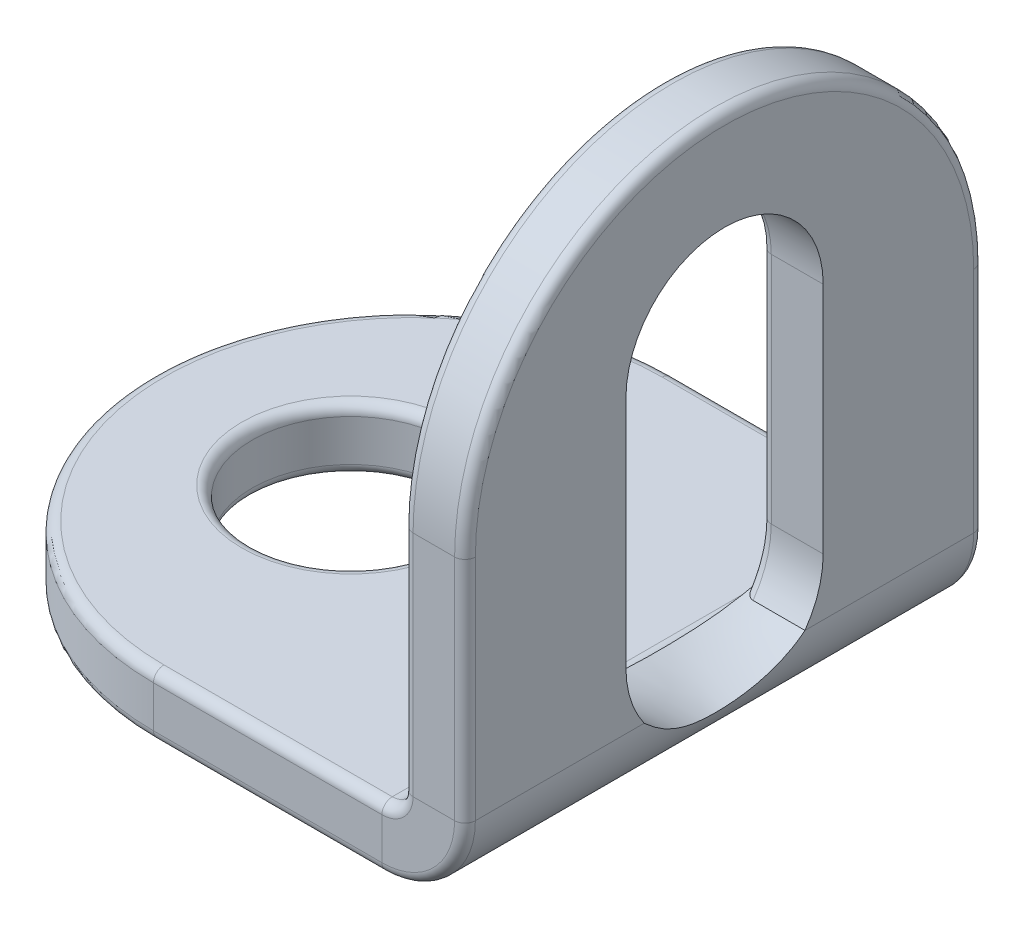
ISO-10303-21;
HEADER;
FILE_DESCRIPTION(('STEP AP214'),'2;1');
FILE_NAME('part.step','',(''),(''),'','','');
FILE_SCHEMA(('AUTOMOTIVE_DESIGN { 1 0 10303 214 1 1 1 1 }'));
ENDSEC;
DATA;
#1=APPLICATION_CONTEXT('core data for automotive mechanical design processes');
#2=APPLICATION_PROTOCOL_DEFINITION('international standard','automotive_design',2000,#1);
#3=PRODUCT_CONTEXT('',#1,'mechanical');
#4=PRODUCT('Part','Part','',(#3));
#5=PRODUCT_RELATED_PRODUCT_CATEGORY('part','',(#4));
#6=PRODUCT_DEFINITION_FORMATION('','',#4);
#7=PRODUCT_DEFINITION_CONTEXT('part definition',#1,'design');
#8=PRODUCT_DEFINITION('design','',#6,#7);
#9=PRODUCT_DEFINITION_SHAPE('','',#8);
#10=(LENGTH_UNIT() NAMED_UNIT(*) SI_UNIT(.MILLI.,.METRE.));
#11=(NAMED_UNIT(*) PLANE_ANGLE_UNIT() SI_UNIT($,.RADIAN.));
#12=(NAMED_UNIT(*) SI_UNIT($,.STERADIAN.) SOLID_ANGLE_UNIT());
#13=UNCERTAINTY_MEASURE_WITH_UNIT(LENGTH_MEASURE(1.E-05),#10,'distance_accuracy_value','');
#14=(GEOMETRIC_REPRESENTATION_CONTEXT(3) GLOBAL_UNCERTAINTY_ASSIGNED_CONTEXT((#13)) GLOBAL_UNIT_ASSIGNED_CONTEXT((#10,
#11,#12)) REPRESENTATION_CONTEXT('',''));
#15=CARTESIAN_POINT('',(0.,0.,0.));
#16=DIRECTION('',(0.,0.,1.));
#17=DIRECTION('',(1.,0.,0.));
#18=AXIS2_PLACEMENT_3D('',#15,#16,#17);
#19=CARTESIAN_POINT('',(6.09599999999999,3.429,-6.35));
#20=DIRECTION('',(1.,0.,0.));
#21=DIRECTION('',(0.,0.,-1.));
#22=AXIS2_PLACEMENT_3D('',#19,#20,#21);
#23=CYLINDRICAL_SURFACE('',#22,2.413);
#24=CARTESIAN_POINT('',(6.09600000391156,2.032,-4.38252446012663));
#25=CARTESIAN_POINT('',(7.62000000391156,2.03200000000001,-4.38252446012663));
#26=B_SPLINE_CURVE_WITH_KNOTS('',1,(#24,#25),.UNSPECIFIED.,.F.,.F.,(2,2),(0.,1.),.UNSPECIFIED.);
#27=CARTESIAN_POINT('',(6.34999999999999,2.032,-4.38252446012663));
#28=VERTEX_POINT('',#27);
#29=CARTESIAN_POINT('',(7.61999999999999,2.03200000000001,-4.38252446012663));
#30=VERTEX_POINT('',#29);
#31=EDGE_CURVE('E263',#28,#30,#26,.T.);
#32=ORIENTED_EDGE('',*,*,#31,.F.);
#33=CARTESIAN_POINT('',(6.34999999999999,3.429,-6.35));
#34=DIRECTION('',(-1.,0.,0.));
#35=DIRECTION('',(0.,-1.,0.));
#36=AXIS2_PLACEMENT_3D('',#33,#34,#35);
#37=CIRCLE('',#36,2.413);
#38=CARTESIAN_POINT('',(6.34999999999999,3.429,-3.937));
#39=VERTEX_POINT('',#38);
#40=EDGE_CURVE('E659',#28,#39,#37,.T.);
#41=ORIENTED_EDGE('',*,*,#40,.T.);
#42=DIRECTION('',(1.,0.,0.));
#43=VECTOR('',#42,1.);
#44=CARTESIAN_POINT('',(6.09599999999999,3.429,-3.937));
#45=LINE('',#44,#43);
#46=CARTESIAN_POINT('',(7.61999999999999,3.429,-3.937));
#47=VERTEX_POINT('',#46);
#48=EDGE_CURVE('E577',#39,#47,#45,.T.);
#49=ORIENTED_EDGE('',*,*,#48,.T.);
#50=CARTESIAN_POINT('',(7.61999999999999,3.429,-6.35));
#51=DIRECTION('',(-1.,0.,0.));
#52=DIRECTION('',(0.,0.,1.));
#53=AXIS2_PLACEMENT_3D('',#50,#51,#52);
#54=CIRCLE('',#53,2.413);
#55=EDGE_CURVE('E570',#30,#47,#54,.T.);
#56=ORIENTED_EDGE('',*,*,#55,.F.);
#57=EDGE_LOOP('',(#32,#41,#49,#56));
#58=FACE_BOUND('',#57,.T.);
#59=ADVANCED_FACE('F64',(#58),#23,.F.);
#60=CARTESIAN_POINT('',(6.09600000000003,-7.62000000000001,-12.7));
#61=DIRECTION('',(0.,0.,1.));
#62=DIRECTION('',(0.,1.,0.));
#63=AXIS2_PLACEMENT_3D('',#60,#61,#62);
#64=PLANE('',#63);
#65=DIRECTION('',(1.,0.,0.));
#66=VECTOR('',#65,1.);
#67=CARTESIAN_POINT('',(6.09599999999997,7.62,-12.7));
#68=LINE('',#67,#66);
#69=CARTESIAN_POINT('',(6.34999999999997,7.62,-12.7));
#70=VERTEX_POINT('',#69);
#71=CARTESIAN_POINT('',(7.36599999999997,7.62,-12.7));
#72=VERTEX_POINT('',#71);
#73=EDGE_CURVE('E740',#70,#72,#68,.T.);
#74=ORIENTED_EDGE('',*,*,#73,.T.);
#75=DIRECTION('',(0.,-1.,0.));
#76=VECTOR('',#75,1.);
#77=CARTESIAN_POINT('',(7.36600000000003,-7.62,-12.7));
#78=LINE('',#77,#76);
#79=CARTESIAN_POINT('',(7.36599999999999,2.032,-12.7));
#80=VERTEX_POINT('',#79);
#81=EDGE_CURVE('E611',#72,#80,#78,.T.);
#82=ORIENTED_EDGE('',*,*,#81,.T.);
#83=DIRECTION('',(-1.,0.,0.));
#84=VECTOR('',#83,1.);
#85=CARTESIAN_POINT('',(6.09599999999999,2.032,-12.7));
#86=LINE('',#85,#84);
#87=CARTESIAN_POINT('',(6.34999999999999,2.032,-12.7));
#88=VERTEX_POINT('',#87);
#89=EDGE_CURVE('E592',#80,#88,#86,.T.);
#90=ORIENTED_EDGE('',*,*,#89,.T.);
#91=DIRECTION('',(0.,-1.,0.));
#92=VECTOR('',#91,1.);
#93=CARTESIAN_POINT('',(6.34999999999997,7.62,-12.7));
#94=LINE('',#93,#92);
#95=EDGE_CURVE('E609',#88,#70,#94,.F.);
#96=ORIENTED_EDGE('',*,*,#95,.T.);
#97=EDGE_LOOP('',(#74,#82,#90,#96));
#98=FACE_BOUND('',#97,.T.);
#99=ADVANCED_FACE('F66',(#98),#64,.F.);
#100=CARTESIAN_POINT('',(6.09600000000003,-7.62000000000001,0.));
#101=DIRECTION('',(0.,0.,-1.));
#102=DIRECTION('',(0.,-1.,0.));
#103=AXIS2_PLACEMENT_3D('',#100,#101,#102);
#104=PLANE('',#103);
#105=DIRECTION('',(1.,0.,0.));
#106=VECTOR('',#105,1.);
#107=CARTESIAN_POINT('',(6.09599999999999,2.032,0.));
#108=LINE('',#107,#106);
#109=CARTESIAN_POINT('',(6.34999999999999,2.032,0.));
#110=VERTEX_POINT('',#109);
#111=CARTESIAN_POINT('',(7.36600000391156,2.032,0.));
#112=VERTEX_POINT('',#111);
#113=EDGE_CURVE('E574',#110,#112,#108,.T.);
#114=ORIENTED_EDGE('',*,*,#113,.T.);
#115=DIRECTION('',(0.,1.,0.));
#116=VECTOR('',#115,1.);
#117=CARTESIAN_POINT('',(7.36600000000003,-7.62,0.));
#118=LINE('',#117,#116);
#119=CARTESIAN_POINT('',(7.36599999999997,7.62,0.));
#120=VERTEX_POINT('',#119);
#121=EDGE_CURVE('E624',#112,#120,#118,.T.);
#122=ORIENTED_EDGE('',*,*,#121,.T.);
#123=DIRECTION('',(1.,0.,0.));
#124=VECTOR('',#123,1.);
#125=CARTESIAN_POINT('',(6.09599999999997,7.62,0.));
#126=LINE('',#125,#124);
#127=CARTESIAN_POINT('',(6.34999999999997,7.62,0.));
#128=VERTEX_POINT('',#127);
#129=EDGE_CURVE('E264',#128,#120,#126,.T.);
#130=ORIENTED_EDGE('',*,*,#129,.F.);
#131=DIRECTION('',(0.,1.,0.));
#132=VECTOR('',#131,1.);
#133=CARTESIAN_POINT('',(6.34999999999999,2.032,0.));
#134=LINE('',#133,#132);
#135=EDGE_CURVE('E622',#128,#110,#134,.F.);
#136=ORIENTED_EDGE('',*,*,#135,.T.);
#137=EDGE_LOOP('',(#114,#122,#130,#136));
#138=FACE_BOUND('',#137,.T.);
#139=ADVANCED_FACE('F448',(#138),#104,.F.);
#140=CARTESIAN_POINT('',(7.62000000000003,-7.62,-6.35));
#141=DIRECTION('',(-1.,0.,0.));
#142=DIRECTION('',(0.,0.,1.));
#143=AXIS2_PLACEMENT_3D('',#140,#141,#142);
#144=PLANE('',#143);
#145=DIRECTION('',(0.,0.,-1.));
#146=VECTOR('',#145,1.);
#147=CARTESIAN_POINT('',(7.61999999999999,2.03200000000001,-6.35));
#148=LINE('',#147,#146);
#149=CARTESIAN_POINT('',(7.61999999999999,2.03200000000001,-8.31747553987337));
#150=VERTEX_POINT('',#149);
#151=CARTESIAN_POINT('',(7.61999999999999,2.03200000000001,-12.446));
#152=VERTEX_POINT('',#151);
#153=EDGE_CURVE('E558',#150,#152,#148,.T.);
#154=ORIENTED_EDGE('',*,*,#153,.T.);
#155=DIRECTION('',(0.,-1.,0.));
#156=VECTOR('',#155,1.);
#157=CARTESIAN_POINT('',(7.62000000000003,-7.62,-12.446));
#158=LINE('',#157,#156);
#159=CARTESIAN_POINT('',(7.61999999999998,7.62,-12.446));
#160=VERTEX_POINT('',#159);
#161=EDGE_CURVE('E616',#152,#160,#158,.F.);
#162=ORIENTED_EDGE('',*,*,#161,.T.);
#163=CARTESIAN_POINT('',(7.61999999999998,7.62,-6.35));
#164=DIRECTION('',(-1.,0.,0.));
#165=DIRECTION('',(0.,-1.,0.));
#166=AXIS2_PLACEMENT_3D('',#163,#164,#165);
#167=CIRCLE('',#166,6.096);
#168=CARTESIAN_POINT('',(7.61999999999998,7.62,-0.254));
#169=VERTEX_POINT('',#168);
#170=EDGE_CURVE('E614',#160,#169,#167,.F.);
#171=ORIENTED_EDGE('',*,*,#170,.T.);
#172=DIRECTION('',(0.,1.,0.));
#173=VECTOR('',#172,1.);
#174=CARTESIAN_POINT('',(7.62000000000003,-7.62,-0.254));
#175=LINE('',#174,#173);
#176=CARTESIAN_POINT('',(7.61999999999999,2.03200000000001,-0.254));
#177=VERTEX_POINT('',#176);
#178=EDGE_CURVE('E573',#169,#177,#175,.F.);
#179=ORIENTED_EDGE('',*,*,#178,.T.);
#180=DIRECTION('',(0.,0.,-1.));
#181=VECTOR('',#180,1.);
#182=CARTESIAN_POINT('',(7.61999999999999,2.03200000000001,-6.35));
#183=LINE('',#182,#181);
#184=EDGE_CURVE('E554',#177,#30,#183,.T.);
#185=ORIENTED_EDGE('',*,*,#184,.T.);
#186=ORIENTED_EDGE('',*,*,#55,.T.);
#187=DIRECTION('',(0.,1.,0.));
#188=VECTOR('',#187,1.);
#189=CARTESIAN_POINT('',(7.61999999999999,3.429,-3.937));
#190=LINE('',#189,#188);
#191=CARTESIAN_POINT('',(7.61999999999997,9.144,-3.937));
#192=VERTEX_POINT('',#191);
#193=EDGE_CURVE('E580',#47,#192,#190,.T.);
#194=ORIENTED_EDGE('',*,*,#193,.T.);
#195=CARTESIAN_POINT('',(7.61999999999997,9.144,-6.35));
#196=DIRECTION('',(-1.,0.,0.));
#197=DIRECTION('',(0.,0.,1.));
#198=AXIS2_PLACEMENT_3D('',#195,#196,#197);
#199=CIRCLE('',#198,2.413);
#200=CARTESIAN_POINT('',(7.61999999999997,9.144,-8.763));
#201=VERTEX_POINT('',#200);
#202=EDGE_CURVE('E732',#192,#201,#199,.T.);
#203=ORIENTED_EDGE('',*,*,#202,.T.);
#204=DIRECTION('',(0.,-1.,0.));
#205=VECTOR('',#204,1.);
#206=CARTESIAN_POINT('',(7.61999999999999,3.429,-8.763));
#207=LINE('',#206,#205);
#208=CARTESIAN_POINT('',(7.61999999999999,3.429,-8.763));
#209=VERTEX_POINT('',#208);
#210=EDGE_CURVE('E478',#201,#209,#207,.T.);
#211=ORIENTED_EDGE('',*,*,#210,.T.);
#212=EDGE_CURVE('E473',#209,#150,#54,.T.);
#213=ORIENTED_EDGE('',*,*,#212,.T.);
#214=EDGE_LOOP('',(#154,#162,#171,#179,#185,#186,#194,#203,#211,#213));
#215=FACE_BOUND('',#214,.T.);
#216=ADVANCED_FACE('F568',(#215),#144,.F.);
#217=CARTESIAN_POINT('',(6.09600000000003,-7.62000000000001,-6.35));
#218=DIRECTION('',(-1.,0.,0.));
#219=DIRECTION('',(0.,0.,1.));
#220=AXIS2_PLACEMENT_3D('',#217,#218,#219);
#221=PLANE('',#220);
#222=CARTESIAN_POINT('',(6.09599999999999,3.429,-6.35));
#223=DIRECTION('',(-1.,0.,0.));
#224=DIRECTION('',(0.,-1.,0.));
#225=AXIS2_PLACEMENT_3D('',#222,#223,#224);
#226=CIRCLE('',#225,2.667);
#227=CARTESIAN_POINT('',(6.09599999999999,3.429,-3.683));
#228=VERTEX_POINT('',#227);
#229=CARTESIAN_POINT('',(6.09599999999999,2.11105564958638,-4.03139876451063));
#230=VERTEX_POINT('',#229);
#231=EDGE_CURVE('E250',#228,#230,#226,.F.);
#232=ORIENTED_EDGE('',*,*,#231,.T.);
#233=CARTESIAN_POINT('',(6.09599999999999,2.11105564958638,-4.03139876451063));
#234=CARTESIAN_POINT('',(6.09599999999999,2.08470376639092,-4.14844066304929));
#235=CARTESIAN_POINT('',(6.09599999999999,2.05835188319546,-4.26548256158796));
#236=CARTESIAN_POINT('',(6.09599999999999,2.032,-4.38252446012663));
#237=B_SPLINE_CURVE_WITH_KNOTS('',3,(#233,#234,#235,#236),.UNSPECIFIED.,.F.,.F.,(4,4),(0.,
0.359915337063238),.UNSPECIFIED.);
#238=CARTESIAN_POINT('',(6.09600000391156,2.032,-4.38252446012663));
#239=VERTEX_POINT('',#238);
#240=EDGE_CURVE('E244',#230,#239,#237,.T.);
#241=ORIENTED_EDGE('',*,*,#240,.T.);
#242=DIRECTION('',(0.,0.,-1.));
#243=VECTOR('',#242,1.);
#244=CARTESIAN_POINT('',(6.09599999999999,2.032,-6.35));
#245=LINE('',#244,#243);
#246=CARTESIAN_POINT('',(6.09599999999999,2.032,-0.254));
#247=VERTEX_POINT('',#246);
#248=EDGE_CURVE('E247',#247,#239,#245,.T.);
#249=ORIENTED_EDGE('',*,*,#248,.F.);
#250=DIRECTION('',(0.,1.,0.));
#251=VECTOR('',#250,1.);
#252=CARTESIAN_POINT('',(6.09599999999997,7.62,-0.254));
#253=LINE('',#252,#251);
#254=CARTESIAN_POINT('',(6.09599999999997,7.62,-0.254));
#255=VERTEX_POINT('',#254);
#256=EDGE_CURVE('E664',#247,#255,#253,.T.);
#257=ORIENTED_EDGE('',*,*,#256,.T.);
#258=CARTESIAN_POINT('',(6.09599999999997,7.62,-6.35));
#259=DIRECTION('',(-1.,0.,0.));
#260=DIRECTION('',(0.,-1.,0.));
#261=AXIS2_PLACEMENT_3D('',#258,#259,#260);
#262=CIRCLE('',#261,6.096);
#263=CARTESIAN_POINT('',(6.09599999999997,7.62,-12.446));
#264=VERTEX_POINT('',#263);
#265=EDGE_CURVE('E666',#255,#264,#262,.T.);
#266=ORIENTED_EDGE('',*,*,#265,.T.);
#267=DIRECTION('',(0.,-1.,0.));
#268=VECTOR('',#267,1.);
#269=CARTESIAN_POINT('',(6.09599999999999,2.032,-12.446));
#270=LINE('',#269,#268);
#271=CARTESIAN_POINT('',(6.09599999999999,2.032,-12.446));
#272=VERTEX_POINT('',#271);
#273=EDGE_CURVE('E672',#264,#272,#270,.T.);
#274=ORIENTED_EDGE('',*,*,#273,.T.);
#275=DIRECTION('',(0.,0.,-1.));
#276=VECTOR('',#275,1.);
#277=CARTESIAN_POINT('',(6.09599999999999,2.032,-6.35));
#278=LINE('',#277,#276);
#279=CARTESIAN_POINT('',(6.09599999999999,2.032,-8.31747553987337));
#280=VERTEX_POINT('',#279);
#281=EDGE_CURVE('E745',#280,#272,#278,.T.);
#282=ORIENTED_EDGE('',*,*,#281,.F.);
#283=CARTESIAN_POINT('',(6.09599999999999,2.032,-8.31747553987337));
#284=CARTESIAN_POINT('',(6.09599999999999,2.05558921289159,-8.43294052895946));
#285=CARTESIAN_POINT('',(6.09599999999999,2.07917842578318,-8.54840551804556));
#286=CARTESIAN_POINT('',(6.09599999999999,2.10276763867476,-8.66387050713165));
#287=B_SPLINE_CURVE_WITH_KNOTS('',3,(#283,#284,#285,#286),.UNSPECIFIED.,.F.,.F.,(4,4),(0.,
0.353549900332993),.UNSPECIFIED.);
#288=CARTESIAN_POINT('',(6.09599999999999,2.10276763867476,-8.66387050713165));
#289=VERTEX_POINT('',#288);
#290=EDGE_CURVE('E84',#280,#289,#287,.T.);
#291=ORIENTED_EDGE('',*,*,#290,.T.);
#292=CARTESIAN_POINT('',(6.09599999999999,3.429,-6.35));
#293=DIRECTION('',(-1.,0.,0.));
#294=DIRECTION('',(0.,-1.,0.));
#295=AXIS2_PLACEMENT_3D('',#292,#293,#294);
#296=CIRCLE('',#295,2.667);
#297=CARTESIAN_POINT('',(6.09599999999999,3.429,-9.017));
#298=VERTEX_POINT('',#297);
#299=EDGE_CURVE('E674',#289,#298,#296,.F.);
#300=ORIENTED_EDGE('',*,*,#299,.T.);
#301=DIRECTION('',(0.,-1.,0.));
#302=VECTOR('',#301,1.);
#303=CARTESIAN_POINT('',(6.09600000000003,-7.62000000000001,-9.017));
#304=LINE('',#303,#302);
#305=CARTESIAN_POINT('',(6.09599999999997,9.14399999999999,-9.017));
#306=VERTEX_POINT('',#305);
#307=EDGE_CURVE('E492',#298,#306,#304,.F.);
#308=ORIENTED_EDGE('',*,*,#307,.T.);
#309=CARTESIAN_POINT('',(6.09599999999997,9.14399999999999,-6.35));
#310=DIRECTION('',(-1.,0.,0.));
#311=DIRECTION('',(0.,-1.,0.));
#312=AXIS2_PLACEMENT_3D('',#309,#310,#311);
#313=CIRCLE('',#312,2.667);
#314=CARTESIAN_POINT('',(6.09599999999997,9.14399999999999,-3.683));
#315=VERTEX_POINT('',#314);
#316=EDGE_CURVE('E675',#306,#315,#313,.F.);
#317=ORIENTED_EDGE('',*,*,#316,.T.);
#318=DIRECTION('',(0.,1.,0.));
#319=VECTOR('',#318,1.);
#320=CARTESIAN_POINT('',(6.09600000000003,-7.62000000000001,-3.683));
#321=LINE('',#320,#319);
#322=EDGE_CURVE('E676',#315,#228,#321,.F.);
#323=ORIENTED_EDGE('',*,*,#322,.T.);
#324=EDGE_LOOP('',(#232,#241,#249,#257,#266,#274,#282,#291,#300,#308,#317,#323));
#325=FACE_BOUND('',#324,.T.);
#326=ADVANCED_FACE('F246',(#325),#221,.T.);
#327=CARTESIAN_POINT('',(6.09599999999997,7.62,-6.35));
#328=DIRECTION('',(1.,0.,0.));
#329=DIRECTION('',(0.,0.,-1.));
#330=AXIS2_PLACEMENT_3D('',#327,#328,#329);
#331=CYLINDRICAL_SURFACE('',#330,6.35);
#332=ORIENTED_EDGE('',*,*,#129,.T.);
#333=CARTESIAN_POINT('',(7.36599999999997,7.62,-6.35));
#334=DIRECTION('',(-1.,0.,0.));
#335=DIRECTION('',(0.,-1.,0.));
#336=AXIS2_PLACEMENT_3D('',#333,#334,#335);
#337=CIRCLE('',#336,6.35);
#338=EDGE_CURVE('E620',#120,#72,#337,.T.);
#339=ORIENTED_EDGE('',*,*,#338,.T.);
#340=ORIENTED_EDGE('',*,*,#73,.F.);
#341=CARTESIAN_POINT('',(6.34999999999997,7.62,-6.35));
#342=DIRECTION('',(-1.,0.,0.));
#343=DIRECTION('',(0.,-1.,0.));
#344=AXIS2_PLACEMENT_3D('',#341,#342,#343);
#345=CIRCLE('',#344,6.35);
#346=EDGE_CURVE('E618',#70,#128,#345,.F.);
#347=ORIENTED_EDGE('',*,*,#346,.T.);
#348=EDGE_LOOP('',(#332,#339,#340,#347));
#349=FACE_BOUND('',#348,.T.);
#350=ADVANCED_FACE('F455',(#349),#331,.T.);
#351=DIRECTION('',(1.,0.,0.));
#352=VECTOR('',#351,1.);
#353=CARTESIAN_POINT('',(6.09599999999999,3.429,-8.763));
#354=LINE('',#353,#352);
#355=CARTESIAN_POINT('',(6.34999999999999,3.429,-8.763));
#356=VERTEX_POINT('',#355);
#357=EDGE_CURVE('E468',#356,#209,#354,.T.);
#358=ORIENTED_EDGE('',*,*,#357,.F.);
#359=CARTESIAN_POINT('',(6.34999999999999,3.429,-6.35));
#360=DIRECTION('',(-1.,0.,0.));
#361=DIRECTION('',(0.,-1.,0.));
#362=AXIS2_PLACEMENT_3D('',#359,#360,#361);
#363=CIRCLE('',#362,2.413);
#364=CARTESIAN_POINT('',(6.34999999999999,2.032,-8.31747553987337));
#365=VERTEX_POINT('',#364);
#366=EDGE_CURVE('E471',#356,#365,#363,.T.);
#367=ORIENTED_EDGE('',*,*,#366,.T.);
#368=CARTESIAN_POINT('',(7.62000000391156,2.03200000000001,-8.31747553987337));
#369=CARTESIAN_POINT('',(6.09600000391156,2.032,-8.31747553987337));
#370=B_SPLINE_CURVE_WITH_KNOTS('',1,(#368,#369),.UNSPECIFIED.,.F.,.F.,(2,2),(0.,1.),.UNSPECIFIED.);
#371=EDGE_CURVE('E559',#150,#365,#370,.T.);
#372=ORIENTED_EDGE('',*,*,#371,.F.);
#373=ORIENTED_EDGE('',*,*,#212,.F.);
#374=EDGE_LOOP('',(#358,#367,#372,#373));
#375=FACE_BOUND('',#374,.T.);
#376=ADVANCED_FACE('F444',(#375),#23,.F.);
#377=CARTESIAN_POINT('',(6.09599999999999,3.429,-3.937));
#378=DIRECTION('',(0.,0.,-1.));
#379=DIRECTION('',(0.,-1.,0.));
#380=AXIS2_PLACEMENT_3D('',#377,#378,#379);
#381=PLANE('',#380);
#382=ORIENTED_EDGE('',*,*,#48,.F.);
#383=DIRECTION('',(0.,1.,0.));
#384=VECTOR('',#383,1.);
#385=CARTESIAN_POINT('',(6.34999999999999,3.429,-3.937));
#386=LINE('',#385,#384);
#387=CARTESIAN_POINT('',(6.34999999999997,9.14399999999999,-3.937));
#388=VERTEX_POINT('',#387);
#389=EDGE_CURVE('E252',#39,#388,#386,.T.);
#390=ORIENTED_EDGE('',*,*,#389,.T.);
#391=DIRECTION('',(1.,0.,0.));
#392=VECTOR('',#391,1.);
#393=CARTESIAN_POINT('',(6.09599999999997,9.14399999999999,-3.937));
#394=LINE('',#393,#392);
#395=EDGE_CURVE('E737',#388,#192,#394,.T.);
#396=ORIENTED_EDGE('',*,*,#395,.T.);
#397=ORIENTED_EDGE('',*,*,#193,.F.);
#398=EDGE_LOOP('',(#382,#390,#396,#397));
#399=FACE_BOUND('',#398,.T.);
#400=ADVANCED_FACE('F454',(#399),#381,.T.);
#401=CARTESIAN_POINT('',(6.09599999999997,9.14399999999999,-6.35));
#402=DIRECTION('',(1.,0.,0.));
#403=DIRECTION('',(0.,0.,-1.));
#404=AXIS2_PLACEMENT_3D('',#401,#402,#403);
#405=CYLINDRICAL_SURFACE('',#404,2.413);
#406=ORIENTED_EDGE('',*,*,#395,.F.);
#407=CARTESIAN_POINT('',(6.34999999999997,9.14399999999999,-6.35));
#408=DIRECTION('',(-1.,0.,0.));
#409=DIRECTION('',(0.,-1.,0.));
#410=AXIS2_PLACEMENT_3D('',#407,#408,#409);
#411=CIRCLE('',#410,2.413);
#412=CARTESIAN_POINT('',(6.34999999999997,9.14399999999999,-8.763));
#413=VERTEX_POINT('',#412);
#414=EDGE_CURVE('E689',#388,#413,#411,.T.);
#415=ORIENTED_EDGE('',*,*,#414,.T.);
#416=DIRECTION('',(1.,0.,0.));
#417=VECTOR('',#416,1.);
#418=CARTESIAN_POINT('',(6.09599999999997,9.14399999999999,-8.763));
#419=LINE('',#418,#417);
#420=EDGE_CURVE('E477',#413,#201,#419,.T.);
#421=ORIENTED_EDGE('',*,*,#420,.T.);
#422=ORIENTED_EDGE('',*,*,#202,.F.);
#423=EDGE_LOOP('',(#406,#415,#421,#422));
#424=FACE_BOUND('',#423,.T.);
#425=ADVANCED_FACE('F461',(#424),#405,.F.);
#426=CARTESIAN_POINT('',(6.09599999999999,3.429,-8.763));
#427=DIRECTION('',(0.,0.,1.));
#428=DIRECTION('',(0.,1.,0.));
#429=AXIS2_PLACEMENT_3D('',#426,#427,#428);
#430=PLANE('',#429);
#431=ORIENTED_EDGE('',*,*,#420,.F.);
#432=DIRECTION('',(0.,-1.,0.));
#433=VECTOR('',#432,1.);
#434=CARTESIAN_POINT('',(6.34999999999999,3.429,-8.763));
#435=LINE('',#434,#433);
#436=EDGE_CURVE('E487',#413,#356,#435,.T.);
#437=ORIENTED_EDGE('',*,*,#436,.T.);
#438=ORIENTED_EDGE('',*,*,#357,.T.);
#439=ORIENTED_EDGE('',*,*,#210,.F.);
#440=EDGE_LOOP('',(#431,#437,#438,#439));
#441=FACE_BOUND('',#440,.T.);
#442=ADVANCED_FACE('F768',(#441),#430,.T.);
#443=CARTESIAN_POINT('',(0.,1.524,-6.35));
#444=DIRECTION('',(0.,-1.,0.));
#445=DIRECTION('',(0.,0.,-1.));
#446=AXIS2_PLACEMENT_3D('',#443,#444,#445);
#447=CYLINDRICAL_SURFACE('',#446,6.35);
#448=DIRECTION('',(0.,-1.,0.));
#449=VECTOR('',#448,1.);
#450=CARTESIAN_POINT('',(0.,1.524,-12.7));
#451=LINE('',#450,#449);
#452=CARTESIAN_POINT('',(0.,1.27,-12.7));
#453=VERTEX_POINT('',#452);
#454=CARTESIAN_POINT('',(0.,0.254000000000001,-12.7));
#455=VERTEX_POINT('',#454);
#456=EDGE_CURVE('E716',#453,#455,#451,.T.);
#457=ORIENTED_EDGE('',*,*,#456,.T.);
#458=CARTESIAN_POINT('',(0.,0.254,-6.35));
#459=DIRECTION('',(0.,1.,0.));
#460=DIRECTION('',(0.,0.,1.));
#461=AXIS2_PLACEMENT_3D('',#458,#459,#460);
#462=CIRCLE('',#461,6.35);
#463=CARTESIAN_POINT('',(0.,0.254000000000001,0.));
#464=VERTEX_POINT('',#463);
#465=EDGE_CURVE('E655',#455,#464,#462,.T.);
#466=ORIENTED_EDGE('',*,*,#465,.T.);
#467=DIRECTION('',(0.,-1.,0.));
#468=VECTOR('',#467,1.);
#469=CARTESIAN_POINT('',(0.,1.524,0.));
#470=LINE('',#469,#468);
#471=CARTESIAN_POINT('',(0.,1.27,0.));
#472=VERTEX_POINT('',#471);
#473=EDGE_CURVE('E578',#472,#464,#470,.T.);
#474=ORIENTED_EDGE('',*,*,#473,.F.);
#475=CARTESIAN_POINT('',(0.,1.27,-6.35));
#476=DIRECTION('',(0.,1.,0.));
#477=DIRECTION('',(0.,0.,1.));
#478=AXIS2_PLACEMENT_3D('',#475,#476,#477);
#479=CIRCLE('',#478,6.35);
#480=EDGE_CURVE('E653',#472,#453,#479,.F.);
#481=ORIENTED_EDGE('',*,*,#480,.T.);
#482=EDGE_LOOP('',(#457,#466,#474,#481));
#483=FACE_BOUND('',#482,.T.);
#484=ADVANCED_FACE('F715',(#483),#447,.T.);
#485=CARTESIAN_POINT('',(-1.524,1.524,-6.35));
#486=DIRECTION('',(0.,-1.,0.));
#487=DIRECTION('',(0.,0.,-1.));
#488=AXIS2_PLACEMENT_3D('',#485,#486,#487);
#489=CYLINDRICAL_SURFACE('',#488,2.413);
#490=CARTESIAN_POINT('',(-1.524,0.254,-6.35));
#491=DIRECTION('',(0.,1.,0.));
#492=DIRECTION('',(0.,0.,1.));
#493=AXIS2_PLACEMENT_3D('',#490,#491,#492);
#494=CIRCLE('',#493,2.413);
#495=CARTESIAN_POINT('',(-1.524,0.254,-8.763));
#496=VERTEX_POINT('',#495);
#497=EDGE_CURVE('E646',#496,#496,#494,.F.);
#498=CARTESIAN_POINT('',(-1.524,1.27,-6.35));
#499=DIRECTION('',(0.,1.,0.));
#500=DIRECTION('',(0.,0.,1.));
#501=AXIS2_PLACEMENT_3D('',#498,#499,#500);
#502=CIRCLE('',#501,2.413);
#503=CARTESIAN_POINT('',(-1.524,1.27,-8.763));
#504=VERTEX_POINT('',#503);
#505=EDGE_CURVE('E643',#504,#504,#502,.T.);
#506=CARTESIAN_POINT('',(-1.524,0.254,-8.763));
#507=CARTESIAN_POINT('',(-1.524,0.264583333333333,-8.763));
#508=CARTESIAN_POINT('',(-1.524,0.275166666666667,-8.763));
#509=CARTESIAN_POINT('',(-1.524,0.296333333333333,-8.763));
#510=CARTESIAN_POINT('',(-1.524,0.306916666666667,-8.763));
#511=CARTESIAN_POINT('',(-1.524,0.328083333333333,-8.763));
#512=CARTESIAN_POINT('',(-1.524,0.338666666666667,-8.763));
#513=CARTESIAN_POINT('',(-1.524,0.359833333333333,-8.763));
#514=CARTESIAN_POINT('',(-1.524,0.370416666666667,-8.763));
#515=CARTESIAN_POINT('',(-1.524,0.391583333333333,-8.763));
#516=CARTESIAN_POINT('',(-1.524,0.402166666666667,-8.763));
#517=CARTESIAN_POINT('',(-1.524,0.423333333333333,-8.763));
#518=CARTESIAN_POINT('',(-1.524,0.433916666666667,-8.763));
#519=CARTESIAN_POINT('',(-1.524,0.455083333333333,-8.763));
#520=CARTESIAN_POINT('',(-1.524,0.465666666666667,-8.763));
#521=CARTESIAN_POINT('',(-1.524,0.486833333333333,-8.763));
#522=CARTESIAN_POINT('',(-1.524,0.497416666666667,-8.763));
#523=CARTESIAN_POINT('',(-1.524,0.518583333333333,-8.763));
#524=CARTESIAN_POINT('',(-1.524,0.529166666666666,-8.763));
#525=CARTESIAN_POINT('',(-1.524,0.550333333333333,-8.763));
#526=CARTESIAN_POINT('',(-1.524,0.560916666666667,-8.763));
#527=CARTESIAN_POINT('',(-1.524,0.582083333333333,-8.763));
#528=CARTESIAN_POINT('',(-1.524,0.592666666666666,-8.763));
#529=CARTESIAN_POINT('',(-1.524,0.613833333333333,-8.763));
#530=CARTESIAN_POINT('',(-1.524,0.624416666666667,-8.763));
#531=CARTESIAN_POINT('',(-1.524,0.645583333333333,-8.763));
#532=CARTESIAN_POINT('',(-1.524,0.656166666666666,-8.763));
#533=CARTESIAN_POINT('',(-1.524,0.677333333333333,-8.763));
#534=CARTESIAN_POINT('',(-1.524,0.687916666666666,-8.763));
#535=CARTESIAN_POINT('',(-1.524,0.709083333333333,-8.763));
#536=CARTESIAN_POINT('',(-1.524,0.719666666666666,-8.763));
#537=CARTESIAN_POINT('',(-1.524,0.740833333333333,-8.763));
#538=CARTESIAN_POINT('',(-1.524,0.751416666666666,-8.763));
#539=CARTESIAN_POINT('',(-1.524,0.772583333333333,-8.763));
#540=CARTESIAN_POINT('',(-1.524,0.783166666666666,-8.763));
#541=CARTESIAN_POINT('',(-1.524,0.804333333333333,-8.763));
#542=CARTESIAN_POINT('',(-1.524,0.814916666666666,-8.763));
#543=CARTESIAN_POINT('',(-1.524,0.836083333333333,-8.763));
#544=CARTESIAN_POINT('',(-1.524,0.846666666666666,-8.763));
#545=CARTESIAN_POINT('',(-1.524,0.867833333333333,-8.763));
#546=CARTESIAN_POINT('',(-1.524,0.878416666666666,-8.763));
#547=CARTESIAN_POINT('',(-1.524,0.899583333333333,-8.763));
#548=CARTESIAN_POINT('',(-1.524,0.910166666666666,-8.763));
#549=CARTESIAN_POINT('',(-1.524,0.931333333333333,-8.763));
#550=CARTESIAN_POINT('',(-1.524,0.941916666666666,-8.763));
#551=CARTESIAN_POINT('',(-1.524,0.963083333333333,-8.763));
#552=CARTESIAN_POINT('',(-1.524,0.973666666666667,-8.763));
#553=CARTESIAN_POINT('',(-1.524,0.994833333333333,-8.763));
#554=CARTESIAN_POINT('',(-1.524,1.00541666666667,-8.763));
#555=CARTESIAN_POINT('',(-1.524,1.02658333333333,-8.763));
#556=CARTESIAN_POINT('',(-1.524,1.03716666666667,-8.763));
#557=CARTESIAN_POINT('',(-1.524,1.05833333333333,-8.763));
#558=CARTESIAN_POINT('',(-1.524,1.06891666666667,-8.763));
#559=CARTESIAN_POINT('',(-1.524,1.09008333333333,-8.763));
#560=CARTESIAN_POINT('',(-1.524,1.10066666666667,-8.763));
#561=CARTESIAN_POINT('',(-1.524,1.12183333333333,-8.763));
#562=CARTESIAN_POINT('',(-1.524,1.13241666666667,-8.763));
#563=CARTESIAN_POINT('',(-1.524,1.15358333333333,-8.763));
#564=CARTESIAN_POINT('',(-1.524,1.16416666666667,-8.763));
#565=CARTESIAN_POINT('',(-1.524,1.18533333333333,-8.763));
#566=CARTESIAN_POINT('',(-1.524,1.19591666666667,-8.763));
#567=CARTESIAN_POINT('',(-1.524,1.21708333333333,-8.763));
#568=CARTESIAN_POINT('',(-1.524,1.22766666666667,-8.763));
#569=CARTESIAN_POINT('',(-1.524,1.24883333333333,-8.763));
#570=CARTESIAN_POINT('',(-1.524,1.25941666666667,-8.763));
#571=CARTESIAN_POINT('',(-1.524,1.27,-8.763));
#572=B_SPLINE_CURVE_WITH_KNOTS('',3,(#506,#507,#508,#509,#510,#511,#512,#513,#514,#515,#516,
#517,#518,#519,#520,#521,#522,#523,#524,#525,#526,#527,#528,#529,#530,#531,#532,#533,#534,#535,
#536,#537,#538,#539,#540,#541,#542,#543,#544,#545,#546,#547,#548,#549,#550,#551,#552,#553,#554,
#555,#556,#557,#558,#559,#560,#561,#562,#563,#564,#565,#566,#567,#568,#569,#570,#571),
.UNSPECIFIED.,.F.,.F.,(4,2,2,2,2,2,2,2,2,2,2,2,2,2,2,2,2,2,2,2,2,2,2,2,2,2,2,2,2,2,2,2,4),(0.,
0.0317500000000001,0.0635,0.0952500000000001,0.127,0.15875,0.1905,0.22225,0.254,0.28575,0.3175,
0.34925,0.381,0.41275,0.4445,0.47625,0.508,0.53975,0.5715,0.60325,0.635,0.66675,0.6985,0.73025,
0.762,0.79375,0.8255,0.85725,0.889,0.92075,0.9525,0.98425,1.016),.UNSPECIFIED.);
#573=EDGE_CURVE('BSEAM806',#496,#504,#572,.T.);
#574=ORIENTED_EDGE('',*,*,#497,.T.);
#575=ORIENTED_EDGE('',*,*,#505,.T.);
#576=ORIENTED_EDGE('',*,*,#573,.T.);
#577=ORIENTED_EDGE('',*,*,#573,.F.);
#578=EDGE_LOOP('',(#574,#576,#575,#577));
#579=FACE_BOUND('',#578,.T.);
#580=ADVANCED_FACE('F806',(#579),#489,.F.);
#581=CARTESIAN_POINT('',(0.,1.524,-6.35));
#582=DIRECTION('',(0.,1.,0.));
#583=DIRECTION('',(0.,0.,1.));
#584=AXIS2_PLACEMENT_3D('',#581,#582,#583);
#585=PLANE('',#584);
#586=CARTESIAN_POINT('',(-1.524,1.524,-6.35));
#587=DIRECTION('',(0.,1.,0.));
#588=DIRECTION('',(0.,0.,1.));
#589=AXIS2_PLACEMENT_3D('',#586,#587,#588);
#590=CIRCLE('',#589,2.667);
#591=CARTESIAN_POINT('',(-1.524,1.524,-3.683));
#592=VERTEX_POINT('',#591);
#593=EDGE_CURVE('E486',#592,#592,#590,.F.);
#594=ORIENTED_EDGE('',*,*,#593,.T.);
#595=EDGE_LOOP('',(#594));
#596=FACE_BOUND('',#595,.T.);
#597=DIRECTION('',(0.,0.,-1.));
#598=VECTOR('',#597,1.);
#599=CARTESIAN_POINT('',(5.58799999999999,1.524,-6.35));
#600=LINE('',#599,#598);
#601=CARTESIAN_POINT('',(5.58799999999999,1.524,-0.254));
#602=VERTEX_POINT('',#601);
#603=CARTESIAN_POINT('',(5.58799999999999,1.524,-12.446));
#604=VERTEX_POINT('',#603);
#605=EDGE_CURVE('E583',#602,#604,#600,.T.);
#606=ORIENTED_EDGE('',*,*,#605,.T.);
#607=DIRECTION('',(-1.,0.,0.));
#608=VECTOR('',#607,1.);
#609=CARTESIAN_POINT('',(0.,1.524,-12.446));
#610=LINE('',#609,#608);
#611=CARTESIAN_POINT('',(0.,1.524,-12.446));
#612=VERTEX_POINT('',#611);
#613=EDGE_CURVE('E92',#604,#612,#610,.T.);
#614=ORIENTED_EDGE('',*,*,#613,.T.);
#615=CARTESIAN_POINT('',(0.,1.524,-6.35));
#616=DIRECTION('',(0.,1.,0.));
#617=DIRECTION('',(0.,0.,1.));
#618=AXIS2_PLACEMENT_3D('',#615,#616,#617);
#619=CIRCLE('',#618,6.096);
#620=CARTESIAN_POINT('',(0.,1.524,-0.254));
#621=VERTEX_POINT('',#620);
#622=EDGE_CURVE('E702',#612,#621,#619,.T.);
#623=ORIENTED_EDGE('',*,*,#622,.T.);
#624=DIRECTION('',(1.,0.,0.));
#625=VECTOR('',#624,1.);
#626=CARTESIAN_POINT('',(5.58799999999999,1.524,-0.254));
#627=LINE('',#626,#625);
#628=EDGE_CURVE('E700',#621,#602,#627,.T.);
#629=ORIENTED_EDGE('',*,*,#628,.T.);
#630=EDGE_LOOP('',(#606,#614,#623,#629));
#631=FACE_BOUND('',#630,.T.);
#632=ADVANCED_FACE('F704',(#596,#631),#585,.T.);
#633=CARTESIAN_POINT('',(0.,1.524,-12.7));
#634=DIRECTION('',(0.,0.,1.));
#635=DIRECTION('',(1.,0.,0.));
#636=AXIS2_PLACEMENT_3D('',#633,#634,#635);
#637=PLANE('',#636);
#638=DIRECTION('',(0.,1.,0.));
#639=VECTOR('',#638,1.);
#640=CARTESIAN_POINT('',(5.58799999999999,1.524,-12.7));
#641=LINE('',#640,#639);
#642=CARTESIAN_POINT('',(5.58799999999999,0.254,-12.7));
#643=VERTEX_POINT('',#642);
#644=CARTESIAN_POINT('',(5.58799999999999,1.27,-12.7));
#645=VERTEX_POINT('',#644);
#646=EDGE_CURVE('E723',#643,#645,#641,.T.);
#647=ORIENTED_EDGE('',*,*,#646,.F.);
#648=DIRECTION('',(-1.,0.,0.));
#649=VECTOR('',#648,1.);
#650=CARTESIAN_POINT('',(0.,0.254,-12.7));
#651=LINE('',#650,#649);
#652=EDGE_CURVE('E651',#643,#455,#651,.T.);
#653=ORIENTED_EDGE('',*,*,#652,.T.);
#654=ORIENTED_EDGE('',*,*,#456,.F.);
#655=DIRECTION('',(-1.,0.,0.));
#656=VECTOR('',#655,1.);
#657=CARTESIAN_POINT('',(5.58799999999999,1.27,-12.7));
#658=LINE('',#657,#656);
#659=EDGE_CURVE('E649',#453,#645,#658,.F.);
#660=ORIENTED_EDGE('',*,*,#659,.T.);
#661=EDGE_LOOP('',(#647,#653,#654,#660));
#662=FACE_BOUND('',#661,.T.);
#663=ADVANCED_FACE('F720',(#662),#637,.F.);
#664=CARTESIAN_POINT('',(0.,0.,-6.35));
#665=DIRECTION('',(0.,1.,0.));
#666=DIRECTION('',(0.,0.,1.));
#667=AXIS2_PLACEMENT_3D('',#664,#665,#666);
#668=PLANE('',#667);
#669=CARTESIAN_POINT('',(-1.524,0.,-6.35));
#670=DIRECTION('',(0.,1.,0.));
#671=DIRECTION('',(0.,0.,1.));
#672=AXIS2_PLACEMENT_3D('',#669,#670,#671);
#673=CIRCLE('',#672,2.667);
#674=CARTESIAN_POINT('',(-1.524,0.,-3.683));
#675=VERTEX_POINT('',#674);
#676=EDGE_CURVE('E640',#675,#675,#673,.T.);
#677=ORIENTED_EDGE('',*,*,#676,.T.);
#678=EDGE_LOOP('',(#677));
#679=FACE_BOUND('',#678,.T.);
#680=CARTESIAN_POINT('',(0.,0.,-6.35));
#681=DIRECTION('',(0.,1.,0.));
#682=DIRECTION('',(0.,0.,1.));
#683=AXIS2_PLACEMENT_3D('',#680,#681,#682);
#684=CIRCLE('',#683,6.096);
#685=CARTESIAN_POINT('',(0.,0.,-0.254));
#686=VERTEX_POINT('',#685);
#687=CARTESIAN_POINT('',(0.,0.,-12.446));
#688=VERTEX_POINT('',#687);
#689=EDGE_CURVE('E636',#686,#688,#684,.F.);
#690=ORIENTED_EDGE('',*,*,#689,.T.);
#691=DIRECTION('',(-1.,0.,0.));
#692=VECTOR('',#691,1.);
#693=CARTESIAN_POINT('',(0.,0.,-12.446));
#694=LINE('',#693,#692);
#695=CARTESIAN_POINT('',(5.58799999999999,0.,-12.446));
#696=VERTEX_POINT('',#695);
#697=EDGE_CURVE('E638',#688,#696,#694,.F.);
#698=ORIENTED_EDGE('',*,*,#697,.T.);
#699=DIRECTION('',(0.,0.,-1.));
#700=VECTOR('',#699,1.);
#701=CARTESIAN_POINT('',(5.58799999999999,0.,-6.35));
#702=LINE('',#701,#700);
#703=CARTESIAN_POINT('',(5.58799999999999,0.,-0.254));
#704=VERTEX_POINT('',#703);
#705=EDGE_CURVE('E726',#704,#696,#702,.T.);
#706=ORIENTED_EDGE('',*,*,#705,.F.);
#707=DIRECTION('',(1.,0.,0.));
#708=VECTOR('',#707,1.);
#709=CARTESIAN_POINT('',(0.,0.,-0.254));
#710=LINE('',#709,#708);
#711=EDGE_CURVE('E634',#704,#686,#710,.F.);
#712=ORIENTED_EDGE('',*,*,#711,.T.);
#713=EDGE_LOOP('',(#690,#698,#706,#712));
#714=FACE_BOUND('',#713,.T.);
#715=ADVANCED_FACE('F833',(#679,#714),#668,.F.);
#716=CARTESIAN_POINT('',(0.,1.524,0.));
#717=DIRECTION('',(0.,0.,-1.));
#718=DIRECTION('',(-1.,0.,0.));
#719=AXIS2_PLACEMENT_3D('',#716,#717,#718);
#720=PLANE('',#719);
#721=ORIENTED_EDGE('',*,*,#473,.T.);
#722=DIRECTION('',(1.,0.,0.));
#723=VECTOR('',#722,1.);
#724=CARTESIAN_POINT('',(0.,0.254,0.));
#725=LINE('',#724,#723);
#726=CARTESIAN_POINT('',(5.58799999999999,0.254,0.));
#727=VERTEX_POINT('',#726);
#728=EDGE_CURVE('E658',#464,#727,#725,.T.);
#729=ORIENTED_EDGE('',*,*,#728,.T.);
#730=DIRECTION('',(0.,-1.,0.));
#731=VECTOR('',#730,1.);
#732=CARTESIAN_POINT('',(5.58799999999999,1.524,0.));
#733=LINE('',#732,#731);
#734=CARTESIAN_POINT('',(5.58799999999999,1.27,0.));
#735=VERTEX_POINT('',#734);
#736=EDGE_CURVE('E269',#735,#727,#733,.T.);
#737=ORIENTED_EDGE('',*,*,#736,.F.);
#738=DIRECTION('',(1.,0.,0.));
#739=VECTOR('',#738,1.);
#740=CARTESIAN_POINT('',(0.,1.27,0.));
#741=LINE('',#740,#739);
#742=EDGE_CURVE('E657',#735,#472,#741,.F.);
#743=ORIENTED_EDGE('',*,*,#742,.T.);
#744=EDGE_LOOP('',(#721,#729,#737,#743));
#745=FACE_BOUND('',#744,.T.);
#746=ADVANCED_FACE('F843',(#745),#720,.F.);
#747=CARTESIAN_POINT('',(5.58799999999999,2.03200000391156,0.));
#748=DIRECTION('',(0.,0.,-1.));
#749=DIRECTION('',(-1.,0.,0.));
#750=AXIS2_PLACEMENT_3D('',#747,#748,#749);
#751=PLANE('',#750);
#752=ORIENTED_EDGE('',*,*,#736,.T.);
#753=CARTESIAN_POINT('',(5.58799999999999,2.032,0.));
#754=DIRECTION('',(0.,0.,-1.));
#755=DIRECTION('',(-1.,0.,0.));
#756=AXIS2_PLACEMENT_3D('',#753,#754,#755);
#757=CIRCLE('',#756,1.77800000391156);
#758=EDGE_CURVE('E628',#727,#112,#757,.F.);
#759=ORIENTED_EDGE('',*,*,#758,.T.);
#760=ORIENTED_EDGE('',*,*,#113,.F.);
#761=CARTESIAN_POINT('',(5.58799999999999,2.032,0.));
#762=DIRECTION('',(0.,0.,-1.));
#763=DIRECTION('',(-1.,0.,0.));
#764=AXIS2_PLACEMENT_3D('',#761,#762,#763);
#765=CIRCLE('',#764,0.762000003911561);
#766=EDGE_CURVE('E626',#110,#735,#765,.T.);
#767=ORIENTED_EDGE('',*,*,#766,.T.);
#768=EDGE_LOOP('',(#752,#759,#760,#767));
#769=FACE_BOUND('',#768,.T.);
#770=ADVANCED_FACE('F294',(#769),#751,.F.);
#771=CARTESIAN_POINT('',(7.62000000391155,2.37214822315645,-4.00483234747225));
#772=CARTESIAN_POINT('',(7.62000000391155,2.2587654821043,-4.13072971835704));
#773=CARTESIAN_POINT('',(7.62000000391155,2.14538274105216,-4.25662708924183));
#774=CARTESIAN_POINT('',(7.62000000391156,2.03200000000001,-4.38252446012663));
#775=CARTESIAN_POINT('',(7.62000000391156,1.89146530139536,-4.53857068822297));
#776=CARTESIAN_POINT('',(7.60564485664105,1.76887379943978,-4.69551049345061));
#777=CARTESIAN_POINT('',(7.56760887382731,1.5616013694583,-5.01148183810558));
#778=CARTESIAN_POINT('',(7.54394868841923,1.4768216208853,-5.17046261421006));
#779=CARTESIAN_POINT('',(7.47943744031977,1.27620533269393,-5.65039025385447));
#780=CARTESIAN_POINT('',(7.44765588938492,1.21303480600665,-5.97432242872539));
#781=CARTESIAN_POINT('',(7.44765588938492,1.21303480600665,-6.63014760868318));
#782=CARTESIAN_POINT('',(7.47943744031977,1.27620533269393,-6.96204061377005));
#783=CARTESIAN_POINT('',(7.54394868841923,1.4768216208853,-7.46585074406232));
#784=CARTESIAN_POINT('',(7.56760887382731,1.5616013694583,-7.63478255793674));
#785=CARTESIAN_POINT('',(7.60564485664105,1.76887379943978,-7.97463639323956));
#786=CARTESIAN_POINT('',(7.62000000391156,1.89147014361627,-8.14550839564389));
#787=CARTESIAN_POINT('',(7.62000000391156,2.03200000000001,-8.31747553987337));
#788=CARTESIAN_POINT('',(7.62000000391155,2.13432588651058,-8.44269227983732));
#789=CARTESIAN_POINT('',(7.62000000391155,2.23665177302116,-8.56790901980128));
#790=CARTESIAN_POINT('',(7.62000000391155,2.33897765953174,-8.69312575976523));
#791=CARTESIAN_POINT('',(6.09600000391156,2.11701237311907,-4.0049419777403));
#792=CARTESIAN_POINT('',(6.09600000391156,2.08867491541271,-4.13080280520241));
#793=CARTESIAN_POINT('',(6.09600000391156,2.06033745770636,-4.25666363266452));
#794=CARTESIAN_POINT('',(6.09600000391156,2.032,-4.38252446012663));
#795=CARTESIAN_POINT('',(6.09600000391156,1.99687652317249,-4.5385253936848));
#796=CARTESIAN_POINT('',(6.0924112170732,1.96621844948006,-4.69551049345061));
#797=CARTESIAN_POINT('',(6.08290222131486,1.91440034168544,-5.01148183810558));
#798=CARTESIAN_POINT('',(6.07698717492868,1.89320540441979,-5.17046261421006));
#799=CARTESIAN_POINT('',(6.06085936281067,1.84305133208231,-5.65039025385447));
#800=CARTESIAN_POINT('',(6.05291397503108,1.82725870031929,-5.97432242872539));
#801=CARTESIAN_POINT('',(6.05291397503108,1.82725870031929,-6.63014760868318));
#802=CARTESIAN_POINT('',(6.06085936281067,1.84305133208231,-6.96204061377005));
#803=CARTESIAN_POINT('',(6.07698717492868,1.89320540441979,-7.46585074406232));
#804=CARTESIAN_POINT('',(6.08290222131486,1.91440034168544,-7.63478255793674));
#805=CARTESIAN_POINT('',(6.0924112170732,1.96621844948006,-7.97463639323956));
#806=CARTESIAN_POINT('',(6.09600000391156,1.99687673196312,-8.14555340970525));
#807=CARTESIAN_POINT('',(6.09600000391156,2.032,-8.31747553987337));
#808=CARTESIAN_POINT('',(6.09600000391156,2.057574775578,-8.44265950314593));
#809=CARTESIAN_POINT('',(6.09600000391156,2.083149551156,-8.56784346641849));
#810=CARTESIAN_POINT('',(6.09600000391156,2.108724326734,-8.69302742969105));
#811=B_SPLINE_SURFACE_WITH_KNOTS('',1,3,((#771,#772,#773,#774,#775,#776,#777,#778,#779,#780,
#781,#782,#783,#784,#785,#786,#787,#788,#789,#790),(#791,#792,#793,#794,#795,#796,#797,#798,
#799,#800,#801,#802,#803,#804,#805,#806,#807,#808,#809,#810)),.UNSPECIFIED.,.F.,.F.,.F.,(2,2),
(4,3,2,2,2,2,2,3,4),(0.,1.),(-0.100849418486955,0.,0.125,0.25,0.5,0.75,0.875,1.,
1.09101792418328),.UNSPECIFIED.);
#812=CARTESIAN_POINT('',(6.09600000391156,2.108724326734,-8.69302742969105));
#813=CARTESIAN_POINT('',(6.09600000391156,2.083149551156,-8.56784346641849));
#814=CARTESIAN_POINT('',(6.09600000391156,2.057574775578,-8.44265950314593));
#815=CARTESIAN_POINT('',(6.09600000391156,2.032,-8.31747553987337));
#816=CARTESIAN_POINT('',(6.09600000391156,1.99687673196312,-8.14555340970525));
#817=CARTESIAN_POINT('',(6.0924112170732,1.96621844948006,-7.97463639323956));
#818=CARTESIAN_POINT('',(6.08290222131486,1.91440034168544,-7.63478255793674));
#819=CARTESIAN_POINT('',(6.07698717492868,1.89320540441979,-7.46585074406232));
#820=CARTESIAN_POINT('',(6.06085936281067,1.84305133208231,-6.96204061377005));
#821=CARTESIAN_POINT('',(6.05291397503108,1.82725870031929,-6.63014760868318));
#822=CARTESIAN_POINT('',(6.05291397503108,1.82725870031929,-5.97432242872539));
#823=CARTESIAN_POINT('',(6.06085936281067,1.84305133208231,-5.65039025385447));
#824=CARTESIAN_POINT('',(6.07698717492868,1.89320540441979,-5.17046261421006));
#825=CARTESIAN_POINT('',(6.08290222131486,1.91440034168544,-5.01148183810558));
#826=CARTESIAN_POINT('',(6.0924112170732,1.96621844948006,-4.69551049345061));
#827=CARTESIAN_POINT('',(6.09600000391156,1.99687652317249,-4.5385253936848));
#828=CARTESIAN_POINT('',(6.09600000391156,2.032,-4.38252446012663));
#829=CARTESIAN_POINT('',(6.09600000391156,2.06033745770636,-4.25666363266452));
#830=CARTESIAN_POINT('',(6.09600000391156,2.08867491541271,-4.13080280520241));
#831=CARTESIAN_POINT('',(6.09600000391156,2.11701237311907,-4.0049419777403));
#832=B_SPLINE_CURVE_WITH_KNOTS('',3,(#812,#813,#814,#815,#816,#817,#818,#819,#820,#821,#822,
#823,#824,#825,#826,#827,#828,#829,#830,#831),.UNSPECIFIED.,.F.,.F.,(4,3,2,2,2,2,2,3,4),
(-0.100849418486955,-0.00983149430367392,0.115168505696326,0.240168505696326,0.490168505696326,
0.740168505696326,0.865168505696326,0.990168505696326,1.09101792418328),.UNSPECIFIED.);
#833=EDGE_CURVE('E258',#239,#280,#832,.F.);
#834=CARTESIAN_POINT('',(6.09599999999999,2.11105564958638,-4.03139876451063));
#835=CARTESIAN_POINT('',(6.09599662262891,2.10636546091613,-4.05223938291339));
#836=CARTESIAN_POINT('',(6.09747480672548,2.10189002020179,-4.07313081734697));
#837=CARTESIAN_POINT('',(6.10342462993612,2.09320454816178,-4.11471882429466));
#838=CARTESIAN_POINT('',(6.10792047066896,2.08899696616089,-4.1354124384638));
#839=CARTESIAN_POINT('',(6.12108517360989,2.07996711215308,-4.17983080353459));
#840=CARTESIAN_POINT('',(6.13038758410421,2.07518113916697,-4.20337855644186));
#841=CARTESIAN_POINT('',(6.15328401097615,2.06574780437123,-4.24827540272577));
#842=CARTESIAN_POINT('',(6.16686251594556,2.06110000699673,-4.26963207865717));
#843=CARTESIAN_POINT('',(6.19165316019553,2.05400624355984,-4.3004451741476));
#844=CARTESIAN_POINT('',(6.20138690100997,2.0514700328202,-4.31108005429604));
#845=CARTESIAN_POINT('',(6.22234889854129,2.04657908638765,-4.33083287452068));
#846=CARTESIAN_POINT('',(6.2335758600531,2.04422419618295,-4.33995211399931));
#847=CARTESIAN_POINT('',(6.25450760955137,2.04043075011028,-4.35406818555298));
#848=CARTESIAN_POINT('',(6.26388583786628,2.03891063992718,-4.35952507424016));
#849=CARTESIAN_POINT('',(6.28339659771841,2.03621290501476,-4.36892134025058));
#850=CARTESIAN_POINT('',(6.2935259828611,2.03503394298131,-4.37286666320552));
#851=CARTESIAN_POINT('',(6.31138505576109,2.0334535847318,-4.37801319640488));
#852=CARTESIAN_POINT('',(6.31896949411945,2.03292614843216,-4.3796769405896));
#853=CARTESIAN_POINT('',(6.33436181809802,2.03219726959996,-4.38194072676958));
#854=CARTESIAN_POINT('',(6.34217088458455,2.03199810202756,-4.38253334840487));
#855=CARTESIAN_POINT('',(6.35,2.032,-4.38252446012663));
#856=B_SPLINE_CURVE_WITH_KNOTS('',3,(#834,#835,#836,#837,#838,#839,#840,#841,#842,#843,#844,
#845,#846,#847,#848,#849,#850,#851,#852,#853,#854,#855),.UNSPECIFIED.,.F.,.F.,(4,2,2,2,2,2,2,2,
2,2,4),(0.,0.0640366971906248,0.128593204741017,0.205493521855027,0.282118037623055,
0.325915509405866,0.369675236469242,0.40243729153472,0.435069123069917,0.458339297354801,
0.481770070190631),.UNSPECIFIED.);
#857=EDGE_CURVE('E78',#230,#28,#856,.T.);
#858=CARTESIAN_POINT('',(7.62000000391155,2.37214822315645,-4.00483234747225));
#859=CARTESIAN_POINT('',(7.62000000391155,2.2587654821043,-4.13072971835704));
#860=CARTESIAN_POINT('',(7.62000000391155,2.14538274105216,-4.25662708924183));
#861=CARTESIAN_POINT('',(7.62000000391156,2.03200000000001,-4.38252446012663));
#862=CARTESIAN_POINT('',(7.62000000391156,1.89146530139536,-4.53857068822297));
#863=CARTESIAN_POINT('',(7.60564485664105,1.76887379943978,-4.69551049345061));
#864=CARTESIAN_POINT('',(7.56760887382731,1.5616013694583,-5.01148183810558));
#865=CARTESIAN_POINT('',(7.54394868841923,1.4768216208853,-5.17046261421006));
#866=CARTESIAN_POINT('',(7.47943744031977,1.27620533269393,-5.65039025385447));
#867=CARTESIAN_POINT('',(7.44765588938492,1.21303480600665,-5.97432242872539));
#868=CARTESIAN_POINT('',(7.44765588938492,1.21303480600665,-6.63014760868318));
#869=CARTESIAN_POINT('',(7.47943744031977,1.27620533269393,-6.96204061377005));
#870=CARTESIAN_POINT('',(7.54394868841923,1.4768216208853,-7.46585074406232));
#871=CARTESIAN_POINT('',(7.56760887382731,1.5616013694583,-7.63478255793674));
#872=CARTESIAN_POINT('',(7.60564485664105,1.76887379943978,-7.97463639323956));
#873=CARTESIAN_POINT('',(7.62000000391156,1.89147014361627,-8.14550839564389));
#874=CARTESIAN_POINT('',(7.62000000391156,2.03200000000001,-8.31747553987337));
#875=CARTESIAN_POINT('',(7.62000000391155,2.13432588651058,-8.44269227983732));
#876=CARTESIAN_POINT('',(7.62000000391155,2.23665177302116,-8.56790901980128));
#877=CARTESIAN_POINT('',(7.62000000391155,2.33897765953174,-8.69312575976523));
#878=B_SPLINE_CURVE_WITH_KNOTS('',3,(#858,#859,#860,#861,#862,#863,#864,#865,#866,#867,#868,
#869,#870,#871,#872,#873,#874,#875,#876,#877),.UNSPECIFIED.,.F.,.F.,(4,3,2,2,2,2,2,3,4),
(-0.100849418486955,0.,0.125,0.25,0.5,0.75,0.875,1.,1.09101792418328),.UNSPECIFIED.);
#879=EDGE_CURVE('E270',#30,#150,#878,.T.);
#880=CARTESIAN_POINT('',(6.34999999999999,2.032,-8.31747553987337));
#881=CARTESIAN_POINT('',(6.33880121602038,2.03199623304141,-8.31745203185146));
#882=CARTESIAN_POINT('',(6.32767871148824,2.0323552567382,-8.31863496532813));
#883=CARTESIAN_POINT('',(6.3060142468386,2.03361640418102,-8.32304224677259));
#884=CARTESIAN_POINT('',(6.29546673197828,2.03451161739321,-8.32624064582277));
#885=CARTESIAN_POINT('',(6.26504556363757,2.03773492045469,-8.33830497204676));
#886=CARTESIAN_POINT('',(6.24621762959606,2.04060587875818,-8.34965033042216));
#887=CARTESIAN_POINT('',(6.21571269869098,2.04620860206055,-8.37352248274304));
#888=CARTESIAN_POINT('',(6.20336625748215,2.04884039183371,-8.38528639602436));
#889=CARTESIAN_POINT('',(6.18070343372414,2.05426240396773,-8.41062895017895));
#890=CARTESIAN_POINT('',(6.17039027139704,2.05705286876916,-8.4242104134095));
#891=CARTESIAN_POINT('',(6.14887720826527,2.06358959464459,-8.45711346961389));
#892=CARTESIAN_POINT('',(6.13840580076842,2.06736225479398,-8.4769033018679));
#893=CARTESIAN_POINT('',(6.12088228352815,2.07502860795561,-8.51791736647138));
#894=CARTESIAN_POINT('',(6.11383236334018,2.07892237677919,-8.53914250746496));
#895=CARTESIAN_POINT('',(6.10431863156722,2.08605712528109,-8.57767396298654));
#896=CARTESIAN_POINT('',(6.10119076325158,2.08925582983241,-8.59482824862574));
#897=CARTESIAN_POINT('',(6.0970348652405,2.09584683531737,-8.62928767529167));
#898=CARTESIAN_POINT('',(6.09599926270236,2.09923839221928,-8.6465920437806));
#899=CARTESIAN_POINT('',(6.09599999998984,2.10276763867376,-8.66387050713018));
#900=B_SPLINE_CURVE_WITH_KNOTS('',3,(#880,#881,#882,#883,#884,#885,#886,#887,#888,#889,#890,
#891,#892,#893,#894,#895,#896,#897,#898,#899),.UNSPECIFIED.,.F.,.F.,(4,2,2,2,2,2,2,2,2,4),(0.,
0.0334081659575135,0.0663947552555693,0.131868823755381,0.183434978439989,0.235082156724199,
0.302854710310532,0.370670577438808,0.423732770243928,0.476602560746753),.UNSPECIFIED.);
#901=EDGE_CURVE('E12',#365,#289,#900,.T.);
#902=ORIENTED_EDGE('',*,*,#833,.F.);
#903=ORIENTED_EDGE('',*,*,#240,.F.);
#904=ORIENTED_EDGE('',*,*,#857,.T.);
#905=ORIENTED_EDGE('',*,*,#31,.T.);
#906=ORIENTED_EDGE('',*,*,#879,.T.);
#907=ORIENTED_EDGE('',*,*,#371,.T.);
#908=ORIENTED_EDGE('',*,*,#901,.T.);
#909=ORIENTED_EDGE('',*,*,#290,.F.);
#910=EDGE_LOOP('',(#902,#903,#904,#905,#906,#907,#908,#909));
#911=FACE_BOUND('',#910,.T.);
#912=ADVANCED_FACE('F267',(#911),#811,.F.);
#913=CARTESIAN_POINT('',(5.58799999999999,2.03200000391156,-12.7));
#914=DIRECTION('',(0.,0.,1.));
#915=DIRECTION('',(1.,0.,0.));
#916=AXIS2_PLACEMENT_3D('',#913,#914,#915);
#917=PLANE('',#916);
#918=ORIENTED_EDGE('',*,*,#89,.F.);
#919=CARTESIAN_POINT('',(5.58799999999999,2.032,-12.7));
#920=DIRECTION('',(0.,0.,1.));
#921=DIRECTION('',(1.,0.,0.));
#922=AXIS2_PLACEMENT_3D('',#919,#920,#921);
#923=CIRCLE('',#922,1.77800000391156);
#924=EDGE_CURVE('E602',#80,#643,#923,.F.);
#925=ORIENTED_EDGE('',*,*,#924,.T.);
#926=ORIENTED_EDGE('',*,*,#646,.T.);
#927=CARTESIAN_POINT('',(5.58799999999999,2.032,-12.7));
#928=DIRECTION('',(0.,0.,1.));
#929=DIRECTION('',(1.,0.,0.));
#930=AXIS2_PLACEMENT_3D('',#927,#928,#929);
#931=CIRCLE('',#930,0.762000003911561);
#932=EDGE_CURVE('E599',#645,#88,#931,.T.);
#933=ORIENTED_EDGE('',*,*,#932,.T.);
#934=EDGE_LOOP('',(#918,#925,#926,#933));
#935=FACE_BOUND('',#934,.T.);
#936=ADVANCED_FACE('F293',(#935),#917,.F.);
#937=CARTESIAN_POINT('',(5.58799999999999,2.032,7.07120233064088));
#938=DIRECTION('',(0.,0.,-1.));
#939=DIRECTION('',(-1.,0.,0.));
#940=AXIS2_PLACEMENT_3D('',#937,#938,#939);
#941=CYLINDRICAL_SURFACE('',#940,0.508000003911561);
#942=ORIENTED_EDGE('',*,*,#281,.T.);
#943=CARTESIAN_POINT('',(5.58799999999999,2.032,-12.446));
#944=DIRECTION('',(0.,0.,1.));
#945=DIRECTION('',(1.,0.,0.));
#946=AXIS2_PLACEMENT_3D('',#943,#944,#945);
#947=CIRCLE('',#946,0.508000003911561);
#948=EDGE_CURVE('E631',#272,#604,#947,.F.);
#949=ORIENTED_EDGE('',*,*,#948,.T.);
#950=ORIENTED_EDGE('',*,*,#605,.F.);
#951=CARTESIAN_POINT('',(5.58799999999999,2.032,-0.254));
#952=DIRECTION('',(0.,0.,-1.));
#953=DIRECTION('',(-1.,0.,0.));
#954=AXIS2_PLACEMENT_3D('',#951,#952,#953);
#955=CIRCLE('',#954,0.508000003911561);
#956=EDGE_CURVE('E262',#602,#247,#955,.F.);
#957=ORIENTED_EDGE('',*,*,#956,.T.);
#958=ORIENTED_EDGE('',*,*,#248,.T.);
#959=ORIENTED_EDGE('',*,*,#833,.T.);
#960=EDGE_LOOP('',(#942,#949,#950,#957,#958,#959));
#961=FACE_BOUND('',#960,.T.);
#962=ADVANCED_FACE('F257',(#961),#941,.F.);
#963=CARTESIAN_POINT('',(5.58799999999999,2.032,7.07120233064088));
#964=DIRECTION('',(0.,0.,-1.));
#965=DIRECTION('',(-1.,0.,0.));
#966=AXIS2_PLACEMENT_3D('',#963,#964,#965);
#967=CYLINDRICAL_SURFACE('',#966,2.03200000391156);
#968=ORIENTED_EDGE('',*,*,#705,.T.);
#969=CARTESIAN_POINT('',(5.58799999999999,2.032,-12.446));
#970=DIRECTION('',(0.,0.,1.));
#971=DIRECTION('',(1.,0.,0.));
#972=AXIS2_PLACEMENT_3D('',#969,#970,#971);
#973=CIRCLE('',#972,2.03200000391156);
#974=EDGE_CURVE('E607',#696,#152,#973,.T.);
#975=ORIENTED_EDGE('',*,*,#974,.T.);
#976=ORIENTED_EDGE('',*,*,#153,.F.);
#977=ORIENTED_EDGE('',*,*,#879,.F.);
#978=ORIENTED_EDGE('',*,*,#184,.F.);
#979=CARTESIAN_POINT('',(5.58799999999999,2.032,-0.254));
#980=DIRECTION('',(0.,0.,-1.));
#981=DIRECTION('',(-1.,0.,0.));
#982=AXIS2_PLACEMENT_3D('',#979,#980,#981);
#983=CIRCLE('',#982,2.03200000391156);
#984=EDGE_CURVE('E604',#177,#704,#983,.T.);
#985=ORIENTED_EDGE('',*,*,#984,.T.);
#986=EDGE_LOOP('',(#968,#975,#976,#977,#978,#985));
#987=FACE_BOUND('',#986,.T.);
#988=ADVANCED_FACE('F430',(#987),#967,.T.);
#989=CARTESIAN_POINT('',(5.58799999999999,2.032,-0.254));
#990=DIRECTION('',(0.,0.,-1.));
#991=DIRECTION('',(-1.,0.,0.));
#992=AXIS2_PLACEMENT_3D('',#989,#990,#991);
#993=TOROIDAL_SURFACE('',#992,1.77800000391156,0.254);
#994=CARTESIAN_POINT('',(5.58799999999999,0.253999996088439,-0.254));
#995=DIRECTION('',(-1.,0.,0.));
#996=DIRECTION('',(0.,0.,1.));
#997=AXIS2_PLACEMENT_3D('',#994,#995,#996);
#998=CIRCLE('',#997,0.254);
#999=EDGE_CURVE('E537',#704,#727,#998,.T.);
#1000=ORIENTED_EDGE('',*,*,#999,.F.);
#1001=ORIENTED_EDGE('',*,*,#984,.F.);
#1002=CARTESIAN_POINT('',(7.36600000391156,2.032,-0.254));
#1003=DIRECTION('',(0.,1.,0.));
#1004=DIRECTION('',(-1.,0.,0.));
#1005=AXIS2_PLACEMENT_3D('',#1002,#1003,#1004);
#1006=CIRCLE('',#1005,0.254);
#1007=EDGE_CURVE('E540',#112,#177,#1006,.T.);
#1008=ORIENTED_EDGE('',*,*,#1007,.F.);
#1009=ORIENTED_EDGE('',*,*,#758,.F.);
#1010=EDGE_LOOP('',(#1000,#1001,#1008,#1009));
#1011=FACE_BOUND('',#1010,.T.);
#1012=ADVANCED_FACE('F427',(#1011),#993,.T.);
#1013=CARTESIAN_POINT('',(7.36600000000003,-7.62,-0.254));
#1014=DIRECTION('',(0.,1.,0.));
#1015=DIRECTION('',(-1.,0.,0.));
#1016=AXIS2_PLACEMENT_3D('',#1013,#1014,#1015);
#1017=CYLINDRICAL_SURFACE('',#1016,0.254);
#1018=ORIENTED_EDGE('',*,*,#1007,.T.);
#1019=ORIENTED_EDGE('',*,*,#178,.F.);
#1020=CARTESIAN_POINT('',(7.36599999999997,7.62,-0.254));
#1021=DIRECTION('',(0.,1.,0.));
#1022=DIRECTION('',(-1.,0.,0.));
#1023=AXIS2_PLACEMENT_3D('',#1020,#1021,#1022);
#1024=CIRCLE('',#1023,0.254);
#1025=EDGE_CURVE('E534',#120,#169,#1024,.T.);
#1026=ORIENTED_EDGE('',*,*,#1025,.F.);
#1027=ORIENTED_EDGE('',*,*,#121,.F.);
#1028=EDGE_LOOP('',(#1018,#1019,#1026,#1027));
#1029=FACE_BOUND('',#1028,.T.);
#1030=ADVANCED_FACE('F423',(#1029),#1017,.T.);
#1031=CARTESIAN_POINT('',(0.,0.254,-0.254));
#1032=DIRECTION('',(1.,0.,0.));
#1033=DIRECTION('',(0.,0.,-1.));
#1034=AXIS2_PLACEMENT_3D('',#1031,#1032,#1033);
#1035=CYLINDRICAL_SURFACE('',#1034,0.254);
#1036=ORIENTED_EDGE('',*,*,#999,.T.);
#1037=ORIENTED_EDGE('',*,*,#728,.F.);
#1038=CARTESIAN_POINT('',(0.,0.254,-0.254));
#1039=DIRECTION('',(-1.,0.,0.));
#1040=DIRECTION('',(0.,0.,1.));
#1041=AXIS2_PLACEMENT_3D('',#1038,#1039,#1040);
#1042=CIRCLE('',#1041,0.254);
#1043=EDGE_CURVE('E531',#686,#464,#1042,.T.);
#1044=ORIENTED_EDGE('',*,*,#1043,.F.);
#1045=ORIENTED_EDGE('',*,*,#711,.F.);
#1046=EDGE_LOOP('',(#1036,#1037,#1044,#1045));
#1047=FACE_BOUND('',#1046,.T.);
#1048=ADVANCED_FACE('F419',(#1047),#1035,.T.);
#1049=CARTESIAN_POINT('',(7.36599999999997,7.62,-6.35));
#1050=DIRECTION('',(-1.,0.,0.));
#1051=DIRECTION('',(0.,-1.,0.));
#1052=AXIS2_PLACEMENT_3D('',#1049,#1050,#1051);
#1053=TOROIDAL_SURFACE('',#1052,6.096,0.254);
#1054=ORIENTED_EDGE('',*,*,#1025,.T.);
#1055=ORIENTED_EDGE('',*,*,#170,.F.);
#1056=CARTESIAN_POINT('',(7.36599999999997,7.62,-12.446));
#1057=DIRECTION('',(0.,-1.,0.));
#1058=DIRECTION('',(1.,0.,0.));
#1059=AXIS2_PLACEMENT_3D('',#1056,#1057,#1058);
#1060=CIRCLE('',#1059,0.254);
#1061=EDGE_CURVE('E528',#72,#160,#1060,.T.);
#1062=ORIENTED_EDGE('',*,*,#1061,.F.);
#1063=ORIENTED_EDGE('',*,*,#338,.F.);
#1064=EDGE_LOOP('',(#1054,#1055,#1062,#1063));
#1065=FACE_BOUND('',#1064,.T.);
#1066=ADVANCED_FACE('F415',(#1065),#1053,.T.);
#1067=CARTESIAN_POINT('',(0.,0.254,-6.35));
#1068=DIRECTION('',(0.,1.,0.));
#1069=DIRECTION('',(0.,0.,1.));
#1070=AXIS2_PLACEMENT_3D('',#1067,#1068,#1069);
#1071=TOROIDAL_SURFACE('',#1070,6.096,0.254);
#1072=ORIENTED_EDGE('',*,*,#1043,.T.);
#1073=ORIENTED_EDGE('',*,*,#465,.F.);
#1074=CARTESIAN_POINT('',(0.,0.254,-12.446));
#1075=DIRECTION('',(1.,0.,0.));
#1076=DIRECTION('',(0.,0.,-1.));
#1077=AXIS2_PLACEMENT_3D('',#1074,#1075,#1076);
#1078=CIRCLE('',#1077,0.254);
#1079=EDGE_CURVE('E525',#688,#455,#1078,.T.);
#1080=ORIENTED_EDGE('',*,*,#1079,.F.);
#1081=ORIENTED_EDGE('',*,*,#689,.F.);
#1082=EDGE_LOOP('',(#1072,#1073,#1080,#1081));
#1083=FACE_BOUND('',#1082,.T.);
#1084=ADVANCED_FACE('F411',(#1083),#1071,.T.);
#1085=CARTESIAN_POINT('',(7.36600000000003,-7.62,-12.446));
#1086=DIRECTION('',(0.,-1.,0.));
#1087=DIRECTION('',(1.,0.,0.));
#1088=AXIS2_PLACEMENT_3D('',#1085,#1086,#1087);
#1089=CYLINDRICAL_SURFACE('',#1088,0.254);
#1090=ORIENTED_EDGE('',*,*,#1061,.T.);
#1091=ORIENTED_EDGE('',*,*,#161,.F.);
#1092=CARTESIAN_POINT('',(7.36599999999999,2.032,-12.446));
#1093=DIRECTION('',(0.,-1.,0.));
#1094=DIRECTION('',(1.,0.,0.));
#1095=AXIS2_PLACEMENT_3D('',#1092,#1093,#1094);
#1096=CIRCLE('',#1095,0.254);
#1097=EDGE_CURVE('E523',#80,#152,#1096,.T.);
#1098=ORIENTED_EDGE('',*,*,#1097,.F.);
#1099=ORIENTED_EDGE('',*,*,#81,.F.);
#1100=EDGE_LOOP('',(#1090,#1091,#1098,#1099));
#1101=FACE_BOUND('',#1100,.T.);
#1102=ADVANCED_FACE('F407',(#1101),#1089,.T.);
#1103=CARTESIAN_POINT('',(0.,0.254,-12.446));
#1104=DIRECTION('',(-1.,0.,0.));
#1105=DIRECTION('',(0.,0.,1.));
#1106=AXIS2_PLACEMENT_3D('',#1103,#1104,#1105);
#1107=CYLINDRICAL_SURFACE('',#1106,0.254);
#1108=ORIENTED_EDGE('',*,*,#1079,.T.);
#1109=ORIENTED_EDGE('',*,*,#652,.F.);
#1110=CARTESIAN_POINT('',(5.58799999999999,0.254,-12.446));
#1111=DIRECTION('',(1.,0.,0.));
#1112=DIRECTION('',(0.,0.,-1.));
#1113=AXIS2_PLACEMENT_3D('',#1110,#1111,#1112);
#1114=CIRCLE('',#1113,0.254);
#1115=EDGE_CURVE('E521',#696,#643,#1114,.T.);
#1116=ORIENTED_EDGE('',*,*,#1115,.F.);
#1117=ORIENTED_EDGE('',*,*,#697,.F.);
#1118=EDGE_LOOP('',(#1108,#1109,#1116,#1117));
#1119=FACE_BOUND('',#1118,.T.);
#1120=ADVANCED_FACE('F403',(#1119),#1107,.T.);
#1121=CARTESIAN_POINT('',(5.58799999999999,2.032,-12.446));
#1122=DIRECTION('',(0.,0.,1.));
#1123=DIRECTION('',(1.,0.,0.));
#1124=AXIS2_PLACEMENT_3D('',#1121,#1122,#1123);
#1125=TOROIDAL_SURFACE('',#1124,1.77800000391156,0.254);
#1126=ORIENTED_EDGE('',*,*,#1097,.T.);
#1127=ORIENTED_EDGE('',*,*,#974,.F.);
#1128=ORIENTED_EDGE('',*,*,#1115,.T.);
#1129=ORIENTED_EDGE('',*,*,#924,.F.);
#1130=EDGE_LOOP('',(#1126,#1127,#1128,#1129));
#1131=FACE_BOUND('',#1130,.T.);
#1132=ADVANCED_FACE('F399',(#1131),#1125,.T.);
#1133=CARTESIAN_POINT('',(5.58799999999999,2.032,-0.254));
#1134=DIRECTION('',(0.,0.,-1.));
#1135=DIRECTION('',(-1.,0.,0.));
#1136=AXIS2_PLACEMENT_3D('',#1133,#1134,#1135);
#1137=TOROIDAL_SURFACE('',#1136,0.762000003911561,0.254);
#1138=CARTESIAN_POINT('',(5.58799999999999,1.26999999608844,-0.254));
#1139=DIRECTION('',(-1.,0.,0.));
#1140=DIRECTION('',(0.,0.,1.));
#1141=AXIS2_PLACEMENT_3D('',#1138,#1139,#1140);
#1142=CIRCLE('',#1141,0.254);
#1143=EDGE_CURVE('E515',#735,#602,#1142,.T.);
#1144=ORIENTED_EDGE('',*,*,#1143,.F.);
#1145=ORIENTED_EDGE('',*,*,#766,.F.);
#1146=CARTESIAN_POINT('',(6.35000000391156,2.032,-0.254));
#1147=DIRECTION('',(0.,1.,0.));
#1148=DIRECTION('',(0.,0.,1.));
#1149=AXIS2_PLACEMENT_3D('',#1146,#1147,#1148);
#1150=CIRCLE('',#1149,0.254);
#1151=EDGE_CURVE('E518',#247,#110,#1150,.T.);
#1152=ORIENTED_EDGE('',*,*,#1151,.F.);
#1153=ORIENTED_EDGE('',*,*,#956,.F.);
#1154=EDGE_LOOP('',(#1144,#1145,#1152,#1153));
#1155=FACE_BOUND('',#1154,.T.);
#1156=ADVANCED_FACE('F395',(#1155),#1137,.T.);
#1157=CARTESIAN_POINT('',(6.35000000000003,-7.62000000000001,-0.254));
#1158=DIRECTION('',(0.,-1.,0.));
#1159=DIRECTION('',(1.,0.,0.));
#1160=AXIS2_PLACEMENT_3D('',#1157,#1158,#1159);
#1161=CYLINDRICAL_SURFACE('',#1160,0.254);
#1162=ORIENTED_EDGE('',*,*,#1151,.T.);
#1163=ORIENTED_EDGE('',*,*,#135,.F.);
#1164=CARTESIAN_POINT('',(6.34999999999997,7.62,-0.254));
#1165=DIRECTION('',(0.,1.,0.));
#1166=DIRECTION('',(-1.,0.,0.));
#1167=AXIS2_PLACEMENT_3D('',#1164,#1165,#1166);
#1168=CIRCLE('',#1167,0.254);
#1169=EDGE_CURVE('E512',#255,#128,#1168,.T.);
#1170=ORIENTED_EDGE('',*,*,#1169,.F.);
#1171=ORIENTED_EDGE('',*,*,#256,.F.);
#1172=EDGE_LOOP('',(#1162,#1163,#1170,#1171));
#1173=FACE_BOUND('',#1172,.T.);
#1174=ADVANCED_FACE('F391',(#1173),#1161,.T.);
#1175=CARTESIAN_POINT('',(0.,1.27,-0.254));
#1176=DIRECTION('',(-1.,0.,0.));
#1177=DIRECTION('',(0.,0.,1.));
#1178=AXIS2_PLACEMENT_3D('',#1175,#1176,#1177);
#1179=CYLINDRICAL_SURFACE('',#1178,0.254);
#1180=ORIENTED_EDGE('',*,*,#1143,.T.);
#1181=ORIENTED_EDGE('',*,*,#628,.F.);
#1182=CARTESIAN_POINT('',(0.,1.27,-0.254));
#1183=DIRECTION('',(-1.,0.,0.));
#1184=DIRECTION('',(0.,0.,1.));
#1185=AXIS2_PLACEMENT_3D('',#1182,#1183,#1184);
#1186=CIRCLE('',#1185,0.254);
#1187=EDGE_CURVE('E509',#472,#621,#1186,.T.);
#1188=ORIENTED_EDGE('',*,*,#1187,.F.);
#1189=ORIENTED_EDGE('',*,*,#742,.F.);
#1190=EDGE_LOOP('',(#1180,#1181,#1188,#1189));
#1191=FACE_BOUND('',#1190,.T.);
#1192=ADVANCED_FACE('F387',(#1191),#1179,.T.);
#1193=CARTESIAN_POINT('',(6.34999999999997,7.62,-6.35));
#1194=DIRECTION('',(-1.,0.,0.));
#1195=DIRECTION('',(0.,-1.,0.));
#1196=AXIS2_PLACEMENT_3D('',#1193,#1194,#1195);
#1197=TOROIDAL_SURFACE('',#1196,6.096,0.254);
#1198=ORIENTED_EDGE('',*,*,#1169,.T.);
#1199=ORIENTED_EDGE('',*,*,#346,.F.);
#1200=CARTESIAN_POINT('',(6.34999999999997,7.62,-12.446));
#1201=DIRECTION('',(0.,-1.,0.));
#1202=DIRECTION('',(1.,0.,0.));
#1203=AXIS2_PLACEMENT_3D('',#1200,#1201,#1202);
#1204=CIRCLE('',#1203,0.254);
#1205=EDGE_CURVE('E506',#264,#70,#1204,.T.);
#1206=ORIENTED_EDGE('',*,*,#1205,.F.);
#1207=ORIENTED_EDGE('',*,*,#265,.F.);
#1208=EDGE_LOOP('',(#1198,#1199,#1206,#1207));
#1209=FACE_BOUND('',#1208,.T.);
#1210=ADVANCED_FACE('F383',(#1209),#1197,.T.);
#1211=CARTESIAN_POINT('',(0.,1.27,-6.35));
#1212=DIRECTION('',(0.,1.,0.));
#1213=DIRECTION('',(0.,0.,1.));
#1214=AXIS2_PLACEMENT_3D('',#1211,#1212,#1213);
#1215=TOROIDAL_SURFACE('',#1214,6.096,0.254);
#1216=ORIENTED_EDGE('',*,*,#1187,.T.);
#1217=ORIENTED_EDGE('',*,*,#622,.F.);
#1218=CARTESIAN_POINT('',(0.,1.27,-12.446));
#1219=DIRECTION('',(1.,0.,0.));
#1220=DIRECTION('',(0.,0.,-1.));
#1221=AXIS2_PLACEMENT_3D('',#1218,#1219,#1220);
#1222=CIRCLE('',#1221,0.254);
#1223=EDGE_CURVE('E503',#453,#612,#1222,.T.);
#1224=ORIENTED_EDGE('',*,*,#1223,.F.);
#1225=ORIENTED_EDGE('',*,*,#480,.F.);
#1226=EDGE_LOOP('',(#1216,#1217,#1224,#1225));
#1227=FACE_BOUND('',#1226,.T.);
#1228=ADVANCED_FACE('F379',(#1227),#1215,.T.);
#1229=CARTESIAN_POINT('',(6.35000000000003,-7.62000000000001,-12.446));
#1230=DIRECTION('',(0.,1.,0.));
#1231=DIRECTION('',(-1.,0.,0.));
#1232=AXIS2_PLACEMENT_3D('',#1229,#1230,#1231);
#1233=CYLINDRICAL_SURFACE('',#1232,0.254);
#1234=ORIENTED_EDGE('',*,*,#1205,.T.);
#1235=ORIENTED_EDGE('',*,*,#95,.F.);
#1236=CARTESIAN_POINT('',(6.34999999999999,2.032,-12.446));
#1237=DIRECTION('',(0.,-1.,0.));
#1238=DIRECTION('',(0.,0.,-1.));
#1239=AXIS2_PLACEMENT_3D('',#1236,#1237,#1238);
#1240=CIRCLE('',#1239,0.254);
#1241=EDGE_CURVE('E496',#272,#88,#1240,.T.);
#1242=ORIENTED_EDGE('',*,*,#1241,.F.);
#1243=ORIENTED_EDGE('',*,*,#273,.F.);
#1244=EDGE_LOOP('',(#1234,#1235,#1242,#1243));
#1245=FACE_BOUND('',#1244,.T.);
#1246=ADVANCED_FACE('F375',(#1245),#1233,.T.);
#1247=CARTESIAN_POINT('',(0.,1.27,-12.446));
#1248=DIRECTION('',(1.,0.,0.));
#1249=DIRECTION('',(0.,0.,-1.));
#1250=AXIS2_PLACEMENT_3D('',#1247,#1248,#1249);
#1251=CYLINDRICAL_SURFACE('',#1250,0.254);
#1252=ORIENTED_EDGE('',*,*,#1223,.T.);
#1253=ORIENTED_EDGE('',*,*,#613,.F.);
#1254=CARTESIAN_POINT('',(5.58799999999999,1.27,-12.446));
#1255=DIRECTION('',(1.,0.,0.));
#1256=DIRECTION('',(0.,0.,-1.));
#1257=AXIS2_PLACEMENT_3D('',#1254,#1255,#1256);
#1258=CIRCLE('',#1257,0.254);
#1259=EDGE_CURVE('E493',#645,#604,#1258,.T.);
#1260=ORIENTED_EDGE('',*,*,#1259,.F.);
#1261=ORIENTED_EDGE('',*,*,#659,.F.);
#1262=EDGE_LOOP('',(#1252,#1253,#1260,#1261));
#1263=FACE_BOUND('',#1262,.T.);
#1264=ADVANCED_FACE('F371',(#1263),#1251,.T.);
#1265=CARTESIAN_POINT('',(5.58799999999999,2.032,-12.446));
#1266=DIRECTION('',(0.,0.,1.));
#1267=DIRECTION('',(1.,0.,0.));
#1268=AXIS2_PLACEMENT_3D('',#1265,#1266,#1267);
#1269=TOROIDAL_SURFACE('',#1268,0.762000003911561,0.254);
#1270=ORIENTED_EDGE('',*,*,#1241,.T.);
#1271=ORIENTED_EDGE('',*,*,#932,.F.);
#1272=ORIENTED_EDGE('',*,*,#1259,.T.);
#1273=ORIENTED_EDGE('',*,*,#948,.F.);
#1274=EDGE_LOOP('',(#1270,#1271,#1272,#1273));
#1275=FACE_BOUND('',#1274,.T.);
#1276=ADVANCED_FACE('F367',(#1275),#1269,.T.);
#1277=CARTESIAN_POINT('',(-1.524,0.254,-6.35));
#1278=DIRECTION('',(0.,1.,0.));
#1279=DIRECTION('',(0.,0.,1.));
#1280=AXIS2_PLACEMENT_3D('',#1277,#1278,#1279);
#1281=TOROIDAL_SURFACE('',#1280,2.667,0.254);
#1282=ORIENTED_EDGE('',*,*,#497,.F.);
#1283=EDGE_LOOP('',(#1282));
#1284=FACE_BOUND('',#1283,.T.);
#1285=ORIENTED_EDGE('',*,*,#676,.F.);
#1286=EDGE_LOOP('',(#1285));
#1287=FACE_BOUND('',#1286,.T.);
#1288=ADVANCED_FACE('F363',(#1284,#1287),#1281,.T.);
#1289=CARTESIAN_POINT('',(6.34999999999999,3.429,-6.35));
#1290=DIRECTION('',(-1.,0.,0.));
#1291=DIRECTION('',(0.,-1.,0.));
#1292=AXIS2_PLACEMENT_3D('',#1289,#1290,#1291);
#1293=TOROIDAL_SURFACE('',#1292,2.667,0.254);
#1294=ORIENTED_EDGE('',*,*,#901,.F.);
#1295=ORIENTED_EDGE('',*,*,#366,.F.);
#1296=CARTESIAN_POINT('',(6.34999999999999,3.429,-9.017));
#1297=DIRECTION('',(0.,1.,0.));
#1298=DIRECTION('',(-1.,0.,0.));
#1299=AXIS2_PLACEMENT_3D('',#1296,#1297,#1298);
#1300=CIRCLE('',#1299,0.254);
#1301=EDGE_CURVE('E484',#298,#356,#1300,.T.);
#1302=ORIENTED_EDGE('',*,*,#1301,.F.);
#1303=ORIENTED_EDGE('',*,*,#299,.F.);
#1304=EDGE_LOOP('',(#1294,#1295,#1302,#1303));
#1305=FACE_BOUND('',#1304,.T.);
#1306=ADVANCED_FACE('F358',(#1305),#1293,.T.);
#1307=CARTESIAN_POINT('',(6.34999999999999,3.429,-9.017));
#1308=DIRECTION('',(0.,-1.,0.));
#1309=DIRECTION('',(1.,0.,0.));
#1310=AXIS2_PLACEMENT_3D('',#1307,#1308,#1309);
#1311=CYLINDRICAL_SURFACE('',#1310,0.254);
#1312=ORIENTED_EDGE('',*,*,#1301,.T.);
#1313=ORIENTED_EDGE('',*,*,#436,.F.);
#1314=CARTESIAN_POINT('',(6.34999999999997,9.14399999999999,-9.017));
#1315=DIRECTION('',(0.,1.,0.));
#1316=DIRECTION('',(-1.,0.,0.));
#1317=AXIS2_PLACEMENT_3D('',#1314,#1315,#1316);
#1318=CIRCLE('',#1317,0.254);
#1319=EDGE_CURVE('E494',#306,#413,#1318,.T.);
#1320=ORIENTED_EDGE('',*,*,#1319,.F.);
#1321=ORIENTED_EDGE('',*,*,#307,.F.);
#1322=EDGE_LOOP('',(#1312,#1313,#1320,#1321));
#1323=FACE_BOUND('',#1322,.T.);
#1324=ADVANCED_FACE('F355',(#1323),#1311,.T.);
#1325=CARTESIAN_POINT('',(6.34999999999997,9.14399999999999,-6.35));
#1326=DIRECTION('',(-1.,0.,0.));
#1327=DIRECTION('',(0.,-1.,0.));
#1328=AXIS2_PLACEMENT_3D('',#1325,#1326,#1327);
#1329=TOROIDAL_SURFACE('',#1328,2.667,0.254);
#1330=ORIENTED_EDGE('',*,*,#1319,.T.);
#1331=ORIENTED_EDGE('',*,*,#414,.F.);
#1332=CARTESIAN_POINT('',(6.34999999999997,9.14399999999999,-3.683));
#1333=DIRECTION('',(0.,-1.,0.));
#1334=DIRECTION('',(1.,0.,0.));
#1335=AXIS2_PLACEMENT_3D('',#1332,#1333,#1334);
#1336=CIRCLE('',#1335,0.254);
#1337=EDGE_CURVE('E498',#315,#388,#1336,.T.);
#1338=ORIENTED_EDGE('',*,*,#1337,.F.);
#1339=ORIENTED_EDGE('',*,*,#316,.F.);
#1340=EDGE_LOOP('',(#1330,#1331,#1338,#1339));
#1341=FACE_BOUND('',#1340,.T.);
#1342=ADVANCED_FACE('F351',(#1341),#1329,.T.);
#1343=CARTESIAN_POINT('',(6.34999999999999,3.429,-3.683));
#1344=DIRECTION('',(0.,1.,0.));
#1345=DIRECTION('',(-1.,0.,0.));
#1346=AXIS2_PLACEMENT_3D('',#1343,#1344,#1345);
#1347=CYLINDRICAL_SURFACE('',#1346,0.254);
#1348=ORIENTED_EDGE('',*,*,#1337,.T.);
#1349=ORIENTED_EDGE('',*,*,#389,.F.);
#1350=CARTESIAN_POINT('',(6.34999999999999,3.429,-3.683));
#1351=DIRECTION('',(0.,-1.,0.));
#1352=DIRECTION('',(1.,0.,0.));
#1353=AXIS2_PLACEMENT_3D('',#1350,#1351,#1352);
#1354=CIRCLE('',#1353,0.254);
#1355=EDGE_CURVE('E685',#228,#39,#1354,.T.);
#1356=ORIENTED_EDGE('',*,*,#1355,.F.);
#1357=ORIENTED_EDGE('',*,*,#322,.F.);
#1358=EDGE_LOOP('',(#1348,#1349,#1356,#1357));
#1359=FACE_BOUND('',#1358,.T.);
#1360=ADVANCED_FACE('F347',(#1359),#1347,.T.);
#1361=CARTESIAN_POINT('',(6.34999999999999,3.429,-6.35));
#1362=DIRECTION('',(-1.,0.,0.));
#1363=DIRECTION('',(0.,-1.,0.));
#1364=AXIS2_PLACEMENT_3D('',#1361,#1362,#1363);
#1365=TOROIDAL_SURFACE('',#1364,2.667,0.254);
#1366=ORIENTED_EDGE('',*,*,#857,.F.);
#1367=ORIENTED_EDGE('',*,*,#231,.F.);
#1368=ORIENTED_EDGE('',*,*,#1355,.T.);
#1369=ORIENTED_EDGE('',*,*,#40,.F.);
#1370=EDGE_LOOP('',(#1366,#1367,#1368,#1369));
#1371=FACE_BOUND('',#1370,.T.);
#1372=ADVANCED_FACE('F341',(#1371),#1365,.T.);
#1373=CARTESIAN_POINT('',(-1.524,1.27,-6.35));
#1374=DIRECTION('',(0.,1.,0.));
#1375=DIRECTION('',(0.,0.,1.));
#1376=AXIS2_PLACEMENT_3D('',#1373,#1374,#1375);
#1377=TOROIDAL_SURFACE('',#1376,2.667,0.254);
#1378=ORIENTED_EDGE('',*,*,#593,.F.);
#1379=EDGE_LOOP('',(#1378));
#1380=FACE_BOUND('',#1379,.T.);
#1381=ORIENTED_EDGE('',*,*,#505,.F.);
#1382=EDGE_LOOP('',(#1381));
#1383=FACE_BOUND('',#1382,.T.);
#1384=ADVANCED_FACE('F346',(#1380,#1383),#1377,.T.);
#1385=CLOSED_SHELL('',(#59,#99,#139,#216,#326,#350,#376,#400,#425,#442,#484,#580,#632,#663,#715,
#746,#770,#912,#936,#962,#988,#1012,#1030,#1048,#1066,#1084,#1102,#1120,#1132,#1156,#1174,#1192,
#1210,#1228,#1246,#1264,#1276,#1288,#1306,#1324,#1342,#1360,#1372,#1384));
#1386=MANIFOLD_SOLID_BREP('B2',#1385);
#1387=ADVANCED_BREP_SHAPE_REPRESENTATION('',(#18,#1386),#14);
#1388=SHAPE_DEFINITION_REPRESENTATION(#9,#1387);
ENDSEC;
END-ISO-10303-21;
